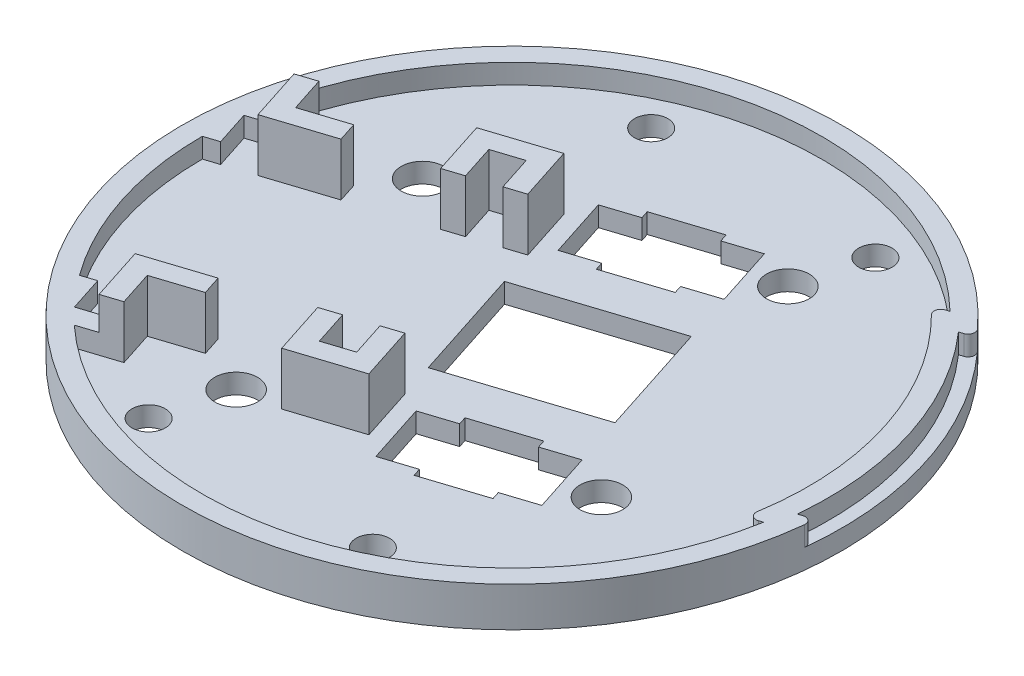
ISO-10303-21;
HEADER;
FILE_DESCRIPTION(('STEP AP214'),'2;1');
FILE_NAME('part.step','',(''),(''),'','','');
FILE_SCHEMA(('AUTOMOTIVE_DESIGN { 1 0 10303 214 1 1 1 1 }'));
ENDSEC;
DATA;
#1=APPLICATION_CONTEXT('core data for automotive mechanical design processes');
#2=APPLICATION_PROTOCOL_DEFINITION('international standard','automotive_design',2000,#1);
#3=PRODUCT_CONTEXT('',#1,'mechanical');
#4=PRODUCT('Part','Part','',(#3));
#5=PRODUCT_RELATED_PRODUCT_CATEGORY('part','',(#4));
#6=PRODUCT_DEFINITION_FORMATION('','',#4);
#7=PRODUCT_DEFINITION_CONTEXT('part definition',#1,'design');
#8=PRODUCT_DEFINITION('design','',#6,#7);
#9=PRODUCT_DEFINITION_SHAPE('','',#8);
#10=(LENGTH_UNIT() NAMED_UNIT(*) SI_UNIT(.MILLI.,.METRE.));
#11=(NAMED_UNIT(*) PLANE_ANGLE_UNIT() SI_UNIT($,.RADIAN.));
#12=(NAMED_UNIT(*) SI_UNIT($,.STERADIAN.) SOLID_ANGLE_UNIT());
#13=UNCERTAINTY_MEASURE_WITH_UNIT(LENGTH_MEASURE(1.E-05),#10,'distance_accuracy_value','');
#14=(GEOMETRIC_REPRESENTATION_CONTEXT(3) GLOBAL_UNCERTAINTY_ASSIGNED_CONTEXT((#13)) GLOBAL_UNIT_ASSIGNED_CONTEXT((#10,
#11,#12)) REPRESENTATION_CONTEXT('',''));
#15=CARTESIAN_POINT('',(0.,0.,0.));
#16=DIRECTION('',(0.,0.,1.));
#17=DIRECTION('',(1.,0.,0.));
#18=AXIS2_PLACEMENT_3D('',#15,#16,#17);
#19=CARTESIAN_POINT('',(0.,4.5,0.));
#20=DIRECTION('',(0.,-1.,0.));
#21=DIRECTION('',(0.,0.,-1.));
#22=AXIS2_PLACEMENT_3D('',#19,#20,#21);
#23=CYLINDRICAL_SURFACE('',#22,47.);
#24=CARTESIAN_POINT('',(0.,4.5,0.));
#25=DIRECTION('',(0.,1.,0.));
#26=DIRECTION('',(0.,0.,1.));
#27=AXIS2_PLACEMENT_3D('',#24,#25,#26);
#28=CIRCLE('',#27,47.);
#29=CARTESIAN_POINT('',(-31.9002259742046,4.5,34.5163089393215));
#30=VERTEX_POINT('',#29);
#31=CARTESIAN_POINT('',(46.2926372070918,4.5,8.12353004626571));
#32=VERTEX_POINT('',#31);
#33=EDGE_CURVE('E1033',#30,#32,#28,.T.);
#34=ORIENTED_EDGE('',*,*,#33,.T.);
#35=DIRECTION('',(0.,-1.,0.));
#36=VECTOR('',#35,1.);
#37=CARTESIAN_POINT('',(46.2926372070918,50.4933208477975,8.12353004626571));
#38=LINE('',#37,#36);
#39=CARTESIAN_POINT('',(46.2926372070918,1.5,8.12353004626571));
#40=VERTEX_POINT('',#39);
#41=EDGE_CURVE('E1225',#32,#40,#38,.T.);
#42=ORIENTED_EDGE('',*,*,#41,.T.);
#43=CARTESIAN_POINT('',(0.,1.5,0.));
#44=DIRECTION('',(0.,1.,0.));
#45=DIRECTION('',(0.,0.,1.));
#46=AXIS2_PLACEMENT_3D('',#43,#44,#45);
#47=CIRCLE('',#46,47.);
#48=CARTESIAN_POINT('',(-31.9002259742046,1.5,34.5163089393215));
#49=VERTEX_POINT('',#48);
#50=EDGE_CURVE('E1041',#40,#49,#47,.F.);
#51=ORIENTED_EDGE('',*,*,#50,.T.);
#52=DIRECTION('',(0.,-1.,0.));
#53=VECTOR('',#52,1.);
#54=CARTESIAN_POINT('',(-31.9002259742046,48.720804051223,34.5163089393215));
#55=LINE('',#54,#53);
#56=EDGE_CURVE('E887',#30,#49,#55,.T.);
#57=ORIENTED_EDGE('',*,*,#56,.F.);
#58=EDGE_LOOP('',(#34,#42,#51,#57));
#59=FACE_BOUND('',#58,.T.);
#60=ADVANCED_FACE('F34',(#59),#23,.F.);
#61=CARTESIAN_POINT('',(0.,1.5,0.));
#62=DIRECTION('',(0.,1.,0.));
#63=DIRECTION('',(0.,0.,1.));
#64=AXIS2_PLACEMENT_3D('',#61,#62,#63);
#65=PLANE('',#64);
#66=DIRECTION('',(0.951288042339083,0.,-0.308303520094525));
#67=VECTOR('',#66,1.);
#68=CARTESIAN_POINT('',(38.1386623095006,1.5,-32.3333022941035));
#69=LINE('',#68,#67);
#70=CARTESIAN_POINT('',(36.0745093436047,1.5,-31.66432970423));
#71=VERTEX_POINT('',#70);
#72=CARTESIAN_POINT('',(36.6957620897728,1.5,-31.8656718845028));
#73=VERTEX_POINT('',#72);
#74=EDGE_CURVE('E1079',#71,#73,#69,.T.);
#75=ORIENTED_EDGE('',*,*,#74,.F.);
#76=CARTESIAN_POINT('',(0.,1.5,0.));
#77=DIRECTION('',(0.,1.,0.));
#78=DIRECTION('',(0.,0.,1.));
#79=AXIS2_PLACEMENT_3D('',#76,#77,#78);
#80=CIRCLE('',#79,48.);
#81=CARTESIAN_POINT('',(47.7900431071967,1.5,4.48461590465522));
#82=VERTEX_POINT('',#81);
#83=EDGE_CURVE('E1317',#82,#71,#80,.T.);
#84=ORIENTED_EDGE('',*,*,#83,.F.);
#85=DIRECTION('',(-0.951288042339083,0.,0.308303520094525));
#86=VECTOR('',#85,1.);
#87=CARTESIAN_POINT('',(49.8541960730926,1.5,3.81564331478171));
#88=LINE('',#87,#86);
#89=CARTESIAN_POINT('',(48.4112958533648,1.5,4.28327372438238));
#90=VERTEX_POINT('',#89);
#91=EDGE_CURVE('E1115',#90,#82,#88,.T.);
#92=ORIENTED_EDGE('',*,*,#91,.F.);
#93=CARTESIAN_POINT('',(48.7195993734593,1.5,5.23456176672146));
#94=DIRECTION('',(0.,1.,0.));
#95=DIRECTION('',(0.,0.,1.));
#96=AXIS2_PLACEMENT_3D('',#93,#94,#95);
#97=CIRCLE('',#96,1.);
#98=CARTESIAN_POINT('',(49.7138769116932,1.5,5.34138955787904));
#99=VERTEX_POINT('',#98);
#100=EDGE_CURVE('E1069',#90,#99,#97,.F.);
#101=ORIENTED_EDGE('',*,*,#100,.T.);
#102=CARTESIAN_POINT('',(0.,1.5,0.));
#103=DIRECTION('',(0.,1.,0.));
#104=DIRECTION('',(0.,0.,1.));
#105=AXIS2_PLACEMENT_3D('',#102,#103,#104);
#106=CIRCLE('',#105,50.);
#107=CARTESIAN_POINT('',(37.1300597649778,1.5,-33.4866938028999));
#108=VERTEX_POINT('',#107);
#109=EDGE_CURVE('E1081',#108,#99,#106,.F.);
#110=ORIENTED_EDGE('',*,*,#109,.F.);
#111=CARTESIAN_POINT('',(36.3874585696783,1.5,-32.8169599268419));
#112=DIRECTION('',(0.,1.,0.));
#113=DIRECTION('',(0.,0.,1.));
#114=AXIS2_PLACEMENT_3D('',#111,#112,#113);
#115=CIRCLE('',#114,1.);
#116=EDGE_CURVE('E1072',#108,#73,#115,.F.);
#117=ORIENTED_EDGE('',*,*,#116,.T.);
#118=EDGE_LOOP('',(#75,#84,#92,#101,#110,#117));
#119=FACE_BOUND('',#118,.T.);
#120=ADVANCED_FACE('F1077',(#119),#65,.T.);
#121=CARTESIAN_POINT('',(27.7110143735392,1.5,14.1456594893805));
#122=DIRECTION('',(0.,1.,0.));
#123=DIRECTION('',(0.,0.,1.));
#124=AXIS2_PLACEMENT_3D('',#121,#122,#123);
#125=CIRCLE('',#124,3.25);
#126=CARTESIAN_POINT('',(27.7110143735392,1.5,17.3956594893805));
#127=VERTEX_POINT('',#126);
#128=EDGE_CURVE('E580',#127,#127,#125,.T.);
#129=ORIENTED_EDGE('',*,*,#128,.F.);
#130=EDGE_LOOP('',(#129));
#131=FACE_BOUND('',#130,.T.);
#132=CARTESIAN_POINT('',(14.1456594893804,1.5,-27.7110143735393));
#133=DIRECTION('',(0.,1.,0.));
#134=DIRECTION('',(0.,0.,1.));
#135=AXIS2_PLACEMENT_3D('',#132,#133,#134);
#136=CIRCLE('',#135,3.25);
#137=CARTESIAN_POINT('',(14.1456594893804,1.5,-24.4610143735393));
#138=VERTEX_POINT('',#137);
#139=EDGE_CURVE('E584',#138,#138,#136,.T.);
#140=ORIENTED_EDGE('',*,*,#139,.F.);
#141=EDGE_LOOP('',(#140));
#142=FACE_BOUND('',#141,.T.);
#143=CARTESIAN_POINT('',(-27.7110143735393,1.5,-14.1456594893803));
#144=DIRECTION('',(0.,1.,0.));
#145=DIRECTION('',(0.,0.,1.));
#146=AXIS2_PLACEMENT_3D('',#143,#144,#145);
#147=CIRCLE('',#146,3.25);
#148=CARTESIAN_POINT('',(-27.7110143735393,1.5,-10.8956594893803));
#149=VERTEX_POINT('',#148);
#150=EDGE_CURVE('E590',#149,#149,#147,.T.);
#151=ORIENTED_EDGE('',*,*,#150,.F.);
#152=EDGE_LOOP('',(#151));
#153=FACE_BOUND('',#152,.T.);
#154=CARTESIAN_POINT('',(-14.1456594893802,1.5,27.7110143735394));
#155=DIRECTION('',(0.,1.,0.));
#156=DIRECTION('',(0.,0.,1.));
#157=AXIS2_PLACEMENT_3D('',#154,#155,#156);
#158=CIRCLE('',#157,3.25);
#159=CARTESIAN_POINT('',(-14.1456594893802,1.5,30.9610143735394));
#160=VERTEX_POINT('',#159);
#161=EDGE_CURVE('E596',#160,#160,#158,.T.);
#162=ORIENTED_EDGE('',*,*,#161,.F.);
#163=EDGE_LOOP('',(#162));
#164=FACE_BOUND('',#163,.T.);
#165=DIRECTION('',(0.951288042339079,0.,-0.308303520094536));
#166=VECTOR('',#165,1.);
#167=CARTESIAN_POINT('',(19.2706018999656,1.5,21.3487447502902));
#168=LINE('',#167,#166);
#169=CARTESIAN_POINT('',(19.2706018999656,1.5,21.3487447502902));
#170=VERTEX_POINT('',#169);
#171=CARTESIAN_POINT('',(24.2648641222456,1.5,19.7301512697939));
#172=VERTEX_POINT('',#171);
#173=EDGE_CURVE('E602',#170,#172,#168,.T.);
#174=ORIENTED_EDGE('',*,*,#173,.F.);
#175=DIRECTION('',(-0.308303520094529,0.,-0.951288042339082));
#176=VECTOR('',#175,1.);
#177=CARTESIAN_POINT('',(19.2706018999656,1.5,21.3487447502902));
#178=LINE('',#177,#176);
#179=CARTESIAN_POINT('',(19.6559813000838,1.5,22.537854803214));
#180=VERTEX_POINT('',#179);
#181=EDGE_CURVE('E609',#180,#170,#178,.T.);
#182=ORIENTED_EDGE('',*,*,#181,.F.);
#183=DIRECTION('',(0.951288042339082,0.,-0.308303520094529));
#184=VECTOR('',#183,1.);
#185=CARTESIAN_POINT('',(10.6187448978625,1.5,25.4667382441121));
#186=LINE('',#185,#184);
#187=CARTESIAN_POINT('',(10.6187448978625,1.5,25.4667382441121));
#188=VERTEX_POINT('',#187);
#189=EDGE_CURVE('E671',#188,#180,#186,.T.);
#190=ORIENTED_EDGE('',*,*,#189,.F.);
#191=DIRECTION('',(0.30830352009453,0.,0.951288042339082));
#192=VECTOR('',#191,1.);
#193=CARTESIAN_POINT('',(10.2333654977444,1.5,24.2776281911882));
#194=LINE('',#193,#192);
#195=CARTESIAN_POINT('',(10.2333654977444,1.5,24.2776281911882));
#196=VERTEX_POINT('',#195);
#197=EDGE_CURVE('E668',#196,#188,#194,.T.);
#198=ORIENTED_EDGE('',*,*,#197,.F.);
#199=DIRECTION('',(0.951288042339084,0.,-0.308303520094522));
#200=VECTOR('',#199,1.);
#201=CARTESIAN_POINT('',(5.23910327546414,1.5,25.8962216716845));
#202=LINE('',#201,#200);
#203=CARTESIAN_POINT('',(5.23910327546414,1.5,25.8962216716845));
#204=VERTEX_POINT('',#203);
#205=EDGE_CURVE('E665',#204,#196,#202,.T.);
#206=ORIENTED_EDGE('',*,*,#205,.F.);
#207=DIRECTION('',(0.308303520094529,0.,0.951288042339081));
#208=VECTOR('',#207,1.);
#209=CARTESIAN_POINT('',(5.23910327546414,1.5,25.8962216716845));
#210=LINE('',#209,#208);
#211=CARTESIAN_POINT('',(2.3102198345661,1.5,16.8589852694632));
#212=VERTEX_POINT('',#211);
#213=EDGE_CURVE('E662',#212,#204,#210,.T.);
#214=ORIENTED_EDGE('',*,*,#213,.F.);
#215=DIRECTION('',(-0.951288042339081,0.,0.30830352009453));
#216=VECTOR('',#215,1.);
#217=CARTESIAN_POINT('',(2.3102198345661,1.5,16.8589852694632));
#218=LINE('',#217,#216);
#219=CARTESIAN_POINT('',(7.3044820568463,1.5,15.2403917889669));
#220=VERTEX_POINT('',#219);
#221=EDGE_CURVE('E659',#220,#212,#218,.T.);
#222=ORIENTED_EDGE('',*,*,#221,.F.);
#223=DIRECTION('',(0.308303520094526,0.,0.951288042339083));
#224=VECTOR('',#223,1.);
#225=CARTESIAN_POINT('',(7.3044820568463,1.5,15.2403917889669));
#226=LINE('',#225,#224);
#227=CARTESIAN_POINT('',(6.91910265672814,1.5,14.051281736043));
#228=VERTEX_POINT('',#227);
#229=EDGE_CURVE('E656',#228,#220,#226,.T.);
#230=ORIENTED_EDGE('',*,*,#229,.F.);
#231=DIRECTION('',(-0.951288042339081,0.,0.30830352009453));
#232=VECTOR('',#231,1.);
#233=CARTESIAN_POINT('',(6.91910265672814,1.5,14.051281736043));
#234=LINE('',#233,#232);
#235=CARTESIAN_POINT('',(15.9563390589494,1.5,11.122398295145));
#236=VERTEX_POINT('',#235);
#237=EDGE_CURVE('E653',#236,#228,#234,.T.);
#238=ORIENTED_EDGE('',*,*,#237,.F.);
#239=DIRECTION('',(-0.308303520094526,0.,-0.951288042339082));
#240=VECTOR('',#239,1.);
#241=CARTESIAN_POINT('',(15.9563390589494,1.5,11.122398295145));
#242=LINE('',#241,#240);
#243=CARTESIAN_POINT('',(16.3417184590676,1.5,12.3115083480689));
#244=VERTEX_POINT('',#243);
#245=EDGE_CURVE('E650',#244,#236,#242,.T.);
#246=ORIENTED_EDGE('',*,*,#245,.F.);
#247=DIRECTION('',(-0.951288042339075,0.,0.30830352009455));
#248=VECTOR('',#247,1.);
#249=CARTESIAN_POINT('',(16.3417184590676,1.5,12.3115083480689));
#250=LINE('',#249,#248);
#251=CARTESIAN_POINT('',(21.3359806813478,1.5,10.6929148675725));
#252=VERTEX_POINT('',#251);
#253=EDGE_CURVE('E647',#252,#244,#250,.T.);
#254=ORIENTED_EDGE('',*,*,#253,.F.);
#255=DIRECTION('',(-0.3083035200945,0.,-0.951288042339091));
#256=VECTOR('',#255,1.);
#257=CARTESIAN_POINT('',(21.3359806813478,1.5,10.6929148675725));
#258=LINE('',#257,#256);
#259=EDGE_CURVE('E644',#172,#252,#258,.T.);
#260=ORIENTED_EDGE('',*,*,#259,.F.);
#261=EDGE_LOOP('',(#174,#182,#190,#198,#206,#214,#222,#230,#238,#246,#254,#260));
#262=FACE_BOUND('',#261,.T.);
#263=DIRECTION('',(0.951288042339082,0.,-0.308303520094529));
#264=VECTOR('',#263,1.);
#265=CARTESIAN_POINT('',(18.9466284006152,1.5,3.32043253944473));
#266=LINE('',#265,#264);
#267=CARTESIAN_POINT('',(-2.45735255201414,1.5,10.2572617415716));
#268=VERTEX_POINT('',#267);
#269=CARTESIAN_POINT('',(18.9466284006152,1.5,3.32043253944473));
#270=VERTEX_POINT('',#269);
#271=EDGE_CURVE('E678',#268,#270,#266,.T.);
#272=ORIENTED_EDGE('',*,*,#271,.F.);
#273=DIRECTION('',(0.30830352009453,0.,0.951288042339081));
#274=VECTOR('',#273,1.);
#275=CARTESIAN_POINT('',(-2.45735255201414,1.5,10.2572617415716));
#276=LINE('',#275,#274);
#277=CARTESIAN_POINT('',(-8.00681591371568,1.5,-6.86592302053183));
#278=VERTEX_POINT('',#277);
#279=EDGE_CURVE('E705',#278,#268,#276,.T.);
#280=ORIENTED_EDGE('',*,*,#279,.F.);
#281=DIRECTION('',(-0.951288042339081,0.,0.30830352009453));
#282=VECTOR('',#281,1.);
#283=CARTESIAN_POINT('',(-8.00681591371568,1.5,-6.86592302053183));
#284=LINE('',#283,#282);
#285=CARTESIAN_POINT('',(13.3971650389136,1.5,-13.8027522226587));
#286=VERTEX_POINT('',#285);
#287=EDGE_CURVE('E719',#286,#278,#284,.T.);
#288=ORIENTED_EDGE('',*,*,#287,.F.);
#289=DIRECTION('',(-0.30830352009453,0.,-0.951288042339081));
#290=VECTOR('',#289,1.);
#291=CARTESIAN_POINT('',(13.3971650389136,1.5,-13.8027522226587));
#292=LINE('',#291,#290);
#293=EDGE_CURVE('E716',#270,#286,#292,.T.);
#294=ORIENTED_EDGE('',*,*,#293,.F.);
#295=EDGE_LOOP('',(#272,#280,#288,#294));
#296=FACE_BOUND('',#295,.T.);
#297=DIRECTION('',(0.30830352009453,0.,0.951288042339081));
#298=VECTOR('',#297,1.);
#299=CARTESIAN_POINT('',(-10.9468315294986,1.5,-24.0464005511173));
#300=LINE('',#299,#298);
#301=CARTESIAN_POINT('',(-10.9468315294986,1.5,-24.0464005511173));
#302=VERTEX_POINT('',#301);
#303=CARTESIAN_POINT('',(-8.01794808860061,1.5,-15.009164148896));
#304=VERTEX_POINT('',#303);
#305=EDGE_CURVE('E726',#302,#304,#300,.T.);
#306=ORIENTED_EDGE('',*,*,#305,.F.);
#307=DIRECTION('',(-0.951288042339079,0.,0.308303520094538));
#308=VECTOR('',#307,1.);
#309=CARTESIAN_POINT('',(-10.9468315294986,1.5,-24.0464005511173));
#310=LINE('',#309,#308);
#311=CARTESIAN_POINT('',(-5.95256930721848,1.5,-25.6649940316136));
#312=VERTEX_POINT('',#311);
#313=EDGE_CURVE('E737',#312,#302,#310,.T.);
#314=ORIENTED_EDGE('',*,*,#313,.F.);
#315=DIRECTION('',(0.308303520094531,0.,0.951288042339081));
#316=VECTOR('',#315,1.);
#317=CARTESIAN_POINT('',(-5.95256930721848,1.5,-25.6649940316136));
#318=LINE('',#317,#316);
#319=CARTESIAN_POINT('',(-6.33794870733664,1.5,-26.8541040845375));
#320=VERTEX_POINT('',#319);
#321=EDGE_CURVE('E799',#320,#312,#318,.T.);
#322=ORIENTED_EDGE('',*,*,#321,.F.);
#323=DIRECTION('',(-0.951288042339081,0.,0.30830352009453));
#324=VECTOR('',#323,1.);
#325=CARTESIAN_POINT('',(-6.33794870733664,1.5,-26.8541040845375));
#326=LINE('',#325,#324);
#327=CARTESIAN_POINT('',(2.69928769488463,1.5,-29.7829875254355));
#328=VERTEX_POINT('',#327);
#329=EDGE_CURVE('E796',#328,#320,#326,.T.);
#330=ORIENTED_EDGE('',*,*,#329,.F.);
#331=DIRECTION('',(-0.308303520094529,0.,-0.951288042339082));
#332=VECTOR('',#331,1.);
#333=CARTESIAN_POINT('',(3.0846670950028,1.5,-28.5938774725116));
#334=LINE('',#333,#332);
#335=CARTESIAN_POINT('',(3.0846670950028,1.5,-28.5938774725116));
#336=VERTEX_POINT('',#335);
#337=EDGE_CURVE('E793',#336,#328,#334,.T.);
#338=ORIENTED_EDGE('',*,*,#337,.F.);
#339=DIRECTION('',(-0.951288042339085,0.,0.30830352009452));
#340=VECTOR('',#339,1.);
#341=CARTESIAN_POINT('',(3.0846670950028,1.5,-28.5938774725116));
#342=LINE('',#341,#340);
#343=CARTESIAN_POINT('',(8.07892931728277,1.5,-30.2124709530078));
#344=VERTEX_POINT('',#343);
#345=EDGE_CURVE('E790',#344,#336,#342,.T.);
#346=ORIENTED_EDGE('',*,*,#345,.F.);
#347=DIRECTION('',(-0.308303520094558,0.,-0.951288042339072));
#348=VECTOR('',#347,1.);
#349=CARTESIAN_POINT('',(11.0078127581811,1.5,-21.1752345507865));
#350=LINE('',#349,#348);
#351=CARTESIAN_POINT('',(11.0078127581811,1.5,-21.1752345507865));
#352=VERTEX_POINT('',#351);
#353=EDGE_CURVE('E787',#352,#344,#350,.T.);
#354=ORIENTED_EDGE('',*,*,#353,.F.);
#355=DIRECTION('',(0.951288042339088,0.,-0.308303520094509));
#356=VECTOR('',#355,1.);
#357=CARTESIAN_POINT('',(6.01355053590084,1.5,-19.5566410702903));
#358=LINE('',#357,#356);
#359=CARTESIAN_POINT('',(6.01355053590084,1.5,-19.5566410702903));
#360=VERTEX_POINT('',#359);
#361=EDGE_CURVE('E784',#360,#352,#358,.T.);
#362=ORIENTED_EDGE('',*,*,#361,.F.);
#363=DIRECTION('',(-0.308303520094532,0.,-0.95128804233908));
#364=VECTOR('',#363,1.);
#365=CARTESIAN_POINT('',(6.39892993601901,1.5,-18.3675310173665));
#366=LINE('',#365,#364);
#367=CARTESIAN_POINT('',(6.39892993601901,1.5,-18.3675310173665));
#368=VERTEX_POINT('',#367);
#369=EDGE_CURVE('E781',#368,#360,#366,.T.);
#370=ORIENTED_EDGE('',*,*,#369,.F.);
#371=DIRECTION('',(0.951288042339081,0.,-0.30830352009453));
#372=VECTOR('',#371,1.);
#373=CARTESIAN_POINT('',(-2.63830646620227,1.5,-15.4386475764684));
#374=LINE('',#373,#372);
#375=CARTESIAN_POINT('',(-2.63830646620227,1.5,-15.4386475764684));
#376=VERTEX_POINT('',#375);
#377=EDGE_CURVE('E778',#376,#368,#374,.T.);
#378=ORIENTED_EDGE('',*,*,#377,.F.);
#379=DIRECTION('',(0.308303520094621,0.,0.951288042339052));
#380=VECTOR('',#379,1.);
#381=CARTESIAN_POINT('',(-3.02368586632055,1.5,-16.6277576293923));
#382=LINE('',#381,#380);
#383=CARTESIAN_POINT('',(-3.02368586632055,1.5,-16.6277576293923));
#384=VERTEX_POINT('',#383);
#385=EDGE_CURVE('E775',#384,#376,#382,.T.);
#386=ORIENTED_EDGE('',*,*,#385,.F.);
#387=DIRECTION('',(0.951288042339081,0.,-0.308303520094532));
#388=VECTOR('',#387,1.);
#389=CARTESIAN_POINT('',(-8.01794808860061,1.5,-15.009164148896));
#390=LINE('',#389,#388);
#391=EDGE_CURVE('E772',#304,#384,#390,.T.);
#392=ORIENTED_EDGE('',*,*,#391,.F.);
#393=EDGE_LOOP('',(#306,#314,#322,#330,#338,#346,#354,#362,#370,#378,#386,#392));
#394=FACE_BOUND('',#393,.T.);
#395=DIRECTION('',(0.951288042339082,0.,-0.308303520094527));
#396=VECTOR('',#395,1.);
#397=CARTESIAN_POINT('',(-40.6193466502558,1.5,-2.07814285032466));
#398=LINE('',#397,#396);
#399=CARTESIAN_POINT('',(-19.6910097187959,1.5,-8.86082029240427));
#400=VERTEX_POINT('',#399);
#401=CARTESIAN_POINT('',(-16.8371455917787,1.5,-9.78573085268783));
#402=VERTEX_POINT('',#401);
#403=EDGE_CURVE('E931',#400,#402,#398,.T.);
#404=ORIENTED_EDGE('',*,*,#403,.F.);
#405=DIRECTION('',(0.308303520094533,0.,0.95128804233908));
#406=VECTOR('',#405,1.);
#407=CARTESIAN_POINT('',(-22.3115896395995,1.5,-16.9467686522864));
#408=LINE('',#407,#406);
#409=CARTESIAN_POINT('',(-22.3115896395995,1.5,-16.9467686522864));
#410=VERTEX_POINT('',#409);
#411=EDGE_CURVE('E960',#410,#400,#408,.T.);
#412=ORIENTED_EDGE('',*,*,#411,.F.);
#413=DIRECTION('',(-0.951288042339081,0.,0.308303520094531));
#414=VECTOR('',#413,1.);
#415=CARTESIAN_POINT('',(-12.3230651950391,1.5,-20.183955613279));
#416=LINE('',#415,#414);
#417=CARTESIAN_POINT('',(-12.3230651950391,1.5,-20.183955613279));
#418=VERTEX_POINT('',#417);
#419=EDGE_CURVE('E963',#418,#410,#416,.T.);
#420=ORIENTED_EDGE('',*,*,#419,.F.);
#421=DIRECTION('',(-0.30830352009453,0.,-0.951288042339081));
#422=VECTOR('',#421,1.);
#423=CARTESIAN_POINT('',(-9.70248527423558,1.5,-12.0980072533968));
#424=LINE('',#423,#422);
#425=CARTESIAN_POINT('',(-9.70248527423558,1.5,-12.0980072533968));
#426=VERTEX_POINT('',#425);
#427=EDGE_CURVE('E967',#426,#418,#424,.T.);
#428=ORIENTED_EDGE('',*,*,#427,.F.);
#429=DIRECTION('',(0.951288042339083,0.,-0.308303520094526));
#430=VECTOR('',#429,1.);
#431=CARTESIAN_POINT('',(-12.5563494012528,1.5,-11.1730966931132));
#432=LINE('',#431,#430);
#433=CARTESIAN_POINT('',(-12.5563494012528,1.5,-11.1730966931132));
#434=VERTEX_POINT('',#433);
#435=EDGE_CURVE('E971',#434,#426,#432,.T.);
#436=ORIENTED_EDGE('',*,*,#435,.F.);
#437=DIRECTION('',(0.308303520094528,0.,0.951288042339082));
#438=VECTOR('',#437,1.);
#439=CARTESIAN_POINT('',(-14.2520187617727,1.5,-16.4051809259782));
#440=LINE('',#439,#438);
#441=CARTESIAN_POINT('',(-14.2520187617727,1.5,-16.4051809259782));
#442=VERTEX_POINT('',#441);
#443=EDGE_CURVE('E975',#442,#434,#440,.T.);
#444=ORIENTED_EDGE('',*,*,#443,.F.);
#445=DIRECTION('',(0.951288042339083,0.,-0.308303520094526));
#446=VECTOR('',#445,1.);
#447=CARTESIAN_POINT('',(-18.5328149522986,1.5,-15.0178150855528));
#448=LINE('',#447,#446);
#449=CARTESIAN_POINT('',(-18.5328149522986,1.5,-15.0178150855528));
#450=VERTEX_POINT('',#449);
#451=EDGE_CURVE('E979',#450,#442,#448,.T.);
#452=ORIENTED_EDGE('',*,*,#451,.F.);
#453=DIRECTION('',(-0.308303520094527,0.,-0.951288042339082));
#454=VECTOR('',#453,1.);
#455=CARTESIAN_POINT('',(-16.8371455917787,1.5,-9.78573085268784));
#456=LINE('',#455,#454);
#457=EDGE_CURVE('E983',#402,#450,#456,.T.);
#458=ORIENTED_EDGE('',*,*,#457,.F.);
#459=EDGE_LOOP('',(#404,#412,#420,#428,#436,#444,#452,#458));
#460=FACE_BOUND('',#459,.T.);
#461=DIRECTION('',(0.308303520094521,0.,0.951288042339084));
#462=VECTOR('',#461,1.);
#463=CARTESIAN_POINT('',(-8.1296277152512,1.5,26.8124812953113));
#464=LINE('',#463,#462);
#465=CARTESIAN_POINT('',(-10.7502076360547,1.5,18.7265329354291));
#466=VERTEX_POINT('',#465);
#467=CARTESIAN_POINT('',(-8.1296277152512,1.5,26.8124812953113));
#468=VERTEX_POINT('',#467);
#469=EDGE_CURVE('E875',#466,#468,#464,.T.);
#470=ORIENTED_EDGE('',*,*,#469,.F.);
#471=DIRECTION('',(-0.951288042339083,0.,0.308303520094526));
#472=VECTOR('',#471,1.);
#473=CARTESIAN_POINT('',(-31.6785445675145,1.5,25.5092103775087));
#474=LINE('',#473,#472);
#475=CARTESIAN_POINT('',(-7.89634350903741,1.5,17.8016223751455));
#476=VERTEX_POINT('',#475);
#477=EDGE_CURVE('E846',#476,#466,#474,.T.);
#478=ORIENTED_EDGE('',*,*,#477,.F.);
#479=DIRECTION('',(-0.308303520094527,0.,-0.951288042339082));
#480=VECTOR('',#479,1.);
#481=CARTESIAN_POINT('',(-7.8963435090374,1.5,17.8016223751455));
#482=LINE('',#481,#480);
#483=CARTESIAN_POINT('',(-6.2006741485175,1.5,23.0337066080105));
#484=VERTEX_POINT('',#483);
#485=EDGE_CURVE('E850',#484,#476,#482,.T.);
#486=ORIENTED_EDGE('',*,*,#485,.F.);
#487=DIRECTION('',(-0.951288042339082,0.,0.308303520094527));
#488=VECTOR('',#487,1.);
#489=CARTESIAN_POINT('',(-6.2006741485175,1.5,23.0337066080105));
#490=LINE('',#489,#488);
#491=CARTESIAN_POINT('',(-1.91987795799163,1.5,21.6463407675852));
#492=VERTEX_POINT('',#491);
#493=EDGE_CURVE('E855',#492,#484,#490,.T.);
#494=ORIENTED_EDGE('',*,*,#493,.F.);
#495=DIRECTION('',(0.308303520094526,0.,0.951288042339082));
#496=VECTOR('',#495,1.);
#497=CARTESIAN_POINT('',(-1.91987795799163,1.5,21.6463407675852));
#498=LINE('',#497,#496);
#499=CARTESIAN_POINT('',(-3.61554731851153,1.5,16.4142565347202));
#500=VERTEX_POINT('',#499);
#501=EDGE_CURVE('E859',#500,#492,#498,.T.);
#502=ORIENTED_EDGE('',*,*,#501,.F.);
#503=DIRECTION('',(-0.951288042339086,0.,0.308303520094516));
#504=VECTOR('',#503,1.);
#505=CARTESIAN_POINT('',(-3.61554731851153,1.5,16.4142565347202));
#506=LINE('',#505,#504);
#507=CARTESIAN_POINT('',(-0.761683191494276,1.5,15.4893459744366));
#508=VERTEX_POINT('',#507);
#509=EDGE_CURVE('E863',#508,#500,#506,.T.);
#510=ORIENTED_EDGE('',*,*,#509,.F.);
#511=DIRECTION('',(-0.308303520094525,0.,-0.951288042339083));
#512=VECTOR('',#511,1.);
#513=CARTESIAN_POINT('',(-0.761683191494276,1.5,15.4893459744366));
#514=LINE('',#513,#512);
#515=CARTESIAN_POINT('',(1.85889672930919,1.5,23.5752943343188));
#516=VERTEX_POINT('',#515);
#517=EDGE_CURVE('E867',#516,#508,#514,.T.);
#518=ORIENTED_EDGE('',*,*,#517,.F.);
#519=DIRECTION('',(0.951288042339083,0.,-0.308303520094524));
#520=VECTOR('',#519,1.);
#521=CARTESIAN_POINT('',(1.85889672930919,1.5,23.5752943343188));
#522=LINE('',#521,#520);
#523=EDGE_CURVE('E871',#468,#516,#522,.T.);
#524=ORIENTED_EDGE('',*,*,#523,.F.);
#525=EDGE_LOOP('',(#470,#478,#486,#494,#502,#510,#518,#524));
#526=FACE_BOUND('',#525,.T.);
#527=CARTESIAN_POINT('',(-17.0092592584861,1.5,38.1280421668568));
#528=DIRECTION('',(0.,1.,0.));
#529=DIRECTION('',(0.,0.,1.));
#530=AXIS2_PLACEMENT_3D('',#527,#528,#529);
#531=CIRCLE('',#530,2.52729999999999);
#532=CARTESIAN_POINT('',(-17.0092592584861,1.5,40.6553421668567));
#533=VERTEX_POINT('',#532);
#534=EDGE_CURVE('E1139',#533,#533,#531,.T.);
#535=ORIENTED_EDGE('',*,*,#534,.F.);
#536=EDGE_LOOP('',(#535));
#537=FACE_BOUND('',#536,.T.);
#538=CARTESIAN_POINT('',(-17.009259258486,1.5,-38.1280421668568));
#539=DIRECTION('',(0.,1.,0.));
#540=DIRECTION('',(0.,0.,1.));
#541=AXIS2_PLACEMENT_3D('',#538,#539,#540);
#542=CIRCLE('',#541,2.52729999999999);
#543=CARTESIAN_POINT('',(-17.009259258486,1.5,-35.6007421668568));
#544=VERTEX_POINT('',#543);
#545=EDGE_CURVE('E1133',#544,#544,#542,.T.);
#546=ORIENTED_EDGE('',*,*,#545,.F.);
#547=EDGE_LOOP('',(#546));
#548=FACE_BOUND('',#547,.T.);
#549=CARTESIAN_POINT('',(17.009259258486,1.5,-38.1280421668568));
#550=DIRECTION('',(0.,1.,0.));
#551=DIRECTION('',(0.,0.,1.));
#552=AXIS2_PLACEMENT_3D('',#549,#550,#551);
#553=CIRCLE('',#552,2.52729999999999);
#554=CARTESIAN_POINT('',(17.009259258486,1.5,-35.6007421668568));
#555=VERTEX_POINT('',#554);
#556=EDGE_CURVE('E1127',#555,#555,#553,.T.);
#557=ORIENTED_EDGE('',*,*,#556,.F.);
#558=EDGE_LOOP('',(#557));
#559=FACE_BOUND('',#558,.T.);
#560=CARTESIAN_POINT('',(17.0092592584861,1.5,38.1280421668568));
#561=DIRECTION('',(0.,1.,0.));
#562=DIRECTION('',(0.,0.,1.));
#563=AXIS2_PLACEMENT_3D('',#560,#561,#562);
#564=CIRCLE('',#563,2.52729999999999);
#565=CARTESIAN_POINT('',(17.0092592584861,1.5,40.6553421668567));
#566=VERTEX_POINT('',#565);
#567=EDGE_CURVE('E1090',#566,#566,#564,.T.);
#568=ORIENTED_EDGE('',*,*,#567,.F.);
#569=EDGE_LOOP('',(#568));
#570=FACE_BOUND('',#569,.T.);
#571=CARTESIAN_POINT('',(0.,1.5,0.));
#572=DIRECTION('',(0.,-1.,0.));
#573=DIRECTION('',(0.,0.,1.));
#574=AXIS2_PLACEMENT_3D('',#571,#572,#573);
#575=CIRCLE('',#574,45.);
#576=CARTESIAN_POINT('',(31.7531417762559,1.5,-31.8863291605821));
#577=VERTEX_POINT('',#576);
#578=CARTESIAN_POINT('',(44.4203951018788,1.5,7.19920127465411));
#579=VERTEX_POINT('',#578);
#580=EDGE_CURVE('E1326',#577,#579,#575,.T.);
#581=ORIENTED_EDGE('',*,*,#580,.F.);
#582=CARTESIAN_POINT('',(32.4587671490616,1.5,-32.5949142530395));
#583=DIRECTION('',(0.,1.,0.));
#584=DIRECTION('',(0.,0.,1.));
#585=AXIS2_PLACEMENT_3D('',#582,#583,#584);
#586=CIRCLE('',#585,1.);
#587=CARTESIAN_POINT('',(32.1504636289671,1.5,-33.5462022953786));
#588=VERTEX_POINT('',#587);
#589=EDGE_CURVE('E42',#577,#588,#586,.F.);
#590=ORIENTED_EDGE('',*,*,#589,.T.);
#591=DIRECTION('',(-0.951288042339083,0.,0.308303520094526));
#592=VECTOR('',#591,1.);
#593=CARTESIAN_POINT('',(32.7272823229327,1.5,-33.7331438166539));
#594=LINE('',#593,#592);
#595=CARTESIAN_POINT('',(32.7272823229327,1.5,-33.7331438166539));
#596=VERTEX_POINT('',#595);
#597=EDGE_CURVE('E1320',#596,#588,#594,.T.);
#598=ORIENTED_EDGE('',*,*,#597,.F.);
#599=CARTESIAN_POINT('',(-46.0821878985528,1.5,-9.24294100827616));
#600=VERTEX_POINT('',#599);
#601=EDGE_CURVE('E1037',#600,#596,#47,.F.);
#602=ORIENTED_EDGE('',*,*,#601,.F.);
#603=DIRECTION('',(-0.951288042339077,0.,0.308303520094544));
#604=VECTOR('',#603,1.);
#605=CARTESIAN_POINT('',(-40.3860624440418,1.5,-11.0890017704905));
#606=LINE('',#605,#604);
#607=CARTESIAN_POINT('',(-40.3860624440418,1.5,-11.0890017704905));
#608=VERTEX_POINT('',#607);
#609=EDGE_CURVE('E949',#608,#600,#606,.T.);
#610=ORIENTED_EDGE('',*,*,#609,.F.);
#611=DIRECTION('',(-0.308303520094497,0.,-0.951288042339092));
#612=VECTOR('',#611,1.);
#613=CARTESIAN_POINT('',(-38.6903930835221,1.5,-5.85691753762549));
#614=LINE('',#613,#612);
#615=CARTESIAN_POINT('',(-38.6903930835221,1.5,-5.85691753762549));
#616=VERTEX_POINT('',#615);
#617=EDGE_CURVE('E954',#616,#608,#614,.T.);
#618=ORIENTED_EDGE('',*,*,#617,.F.);
#619=DIRECTION('',(-0.951288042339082,0.,0.308303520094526));
#620=VECTOR('',#619,1.);
#621=CARTESIAN_POINT('',(-20.6159202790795,1.5,-11.7146844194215));
#622=LINE('',#621,#620);
#623=CARTESIAN_POINT('',(-32.0313767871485,1.5,-8.01504217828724));
#624=VERTEX_POINT('',#623);
#625=EDGE_CURVE('E958',#624,#616,#622,.T.);
#626=ORIENTED_EDGE('',*,*,#625,.F.);
#627=DIRECTION('',(0.308303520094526,0.,0.951288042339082));
#628=VECTOR('',#627,1.);
#629=CARTESIAN_POINT('',(-32.0313767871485,1.5,-8.01504217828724));
#630=LINE('',#629,#628);
#631=CARTESIAN_POINT('',(-31.1064662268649,1.5,-5.16117805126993));
#632=VERTEX_POINT('',#631);
#633=EDGE_CURVE('E535',#624,#632,#630,.T.);
#634=ORIENTED_EDGE('',*,*,#633,.T.);
#635=CARTESIAN_POINT('',(-40.6193466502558,1.5,-2.07814285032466));
#636=VERTEX_POINT('',#635);
#637=EDGE_CURVE('E927',#636,#632,#398,.T.);
#638=ORIENTED_EDGE('',*,*,#637,.F.);
#639=DIRECTION('',(0.308303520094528,0.,0.951288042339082));
#640=VECTOR('',#639,1.);
#641=CARTESIAN_POINT('',(-42.3150160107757,1.5,-7.31022708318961));
#642=LINE('',#641,#640);
#643=CARTESIAN_POINT('',(-42.3150160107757,1.5,-7.31022708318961));
#644=VERTEX_POINT('',#643);
#645=EDGE_CURVE('E932',#644,#636,#642,.T.);
#646=ORIENTED_EDGE('',*,*,#645,.F.);
#647=DIRECTION('',(0.951288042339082,0.,-0.308303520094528));
#648=VECTOR('',#647,1.);
#649=CARTESIAN_POINT('',(-46.5958122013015,1.5,-5.92286124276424));
#650=LINE('',#649,#648);
#651=CARTESIAN_POINT('',(-46.5958122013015,1.5,-5.92286124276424));
#652=VERTEX_POINT('',#651);
#653=EDGE_CURVE('E937',#652,#644,#650,.T.);
#654=ORIENTED_EDGE('',*,*,#653,.F.);
#655=DIRECTION('',(-0.308303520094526,0.,-0.951288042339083));
#656=VECTOR('',#655,1.);
#657=CARTESIAN_POINT('',(-44.9001428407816,1.5,-0.690777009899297));
#658=LINE('',#657,#656);
#659=CARTESIAN_POINT('',(-44.9001428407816,1.5,-0.690777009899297));
#660=VERTEX_POINT('',#659);
#661=EDGE_CURVE('E941',#660,#652,#658,.T.);
#662=ORIENTED_EDGE('',*,*,#661,.F.);
#663=DIRECTION('',(0.951288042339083,0.,-0.308303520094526));
#664=VECTOR('',#663,1.);
#665=CARTESIAN_POINT('',(-46.9999988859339,1.5,-0.0102333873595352));
#666=LINE('',#665,#664);
#667=CARTESIAN_POINT('',(-46.9999988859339,1.5,-0.0102333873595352));
#668=VERTEX_POINT('',#667);
#669=EDGE_CURVE('E945',#668,#660,#666,.T.);
#670=ORIENTED_EDGE('',*,*,#669,.F.);
#671=CARTESIAN_POINT('',(-38.0591968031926,1.5,27.5771198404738));
#672=VERTEX_POINT('',#671);
#673=EDGE_CURVE('E1036',#672,#668,#47,.F.);
#674=ORIENTED_EDGE('',*,*,#673,.F.);
#675=DIRECTION('',(-0.951288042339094,0.,0.30830352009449));
#676=VECTOR('',#675,1.);
#677=CARTESIAN_POINT('',(-38.0591968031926,1.5,27.5771198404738));
#678=LINE('',#677,#676);
#679=CARTESIAN_POINT('',(-35.9593407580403,1.5,26.8965762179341));
#680=VERTEX_POINT('',#679);
#681=EDGE_CURVE('E829',#680,#672,#678,.T.);
#682=ORIENTED_EDGE('',*,*,#681,.F.);
#683=DIRECTION('',(-0.308303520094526,0.,-0.951288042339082));
#684=VECTOR('',#683,1.);
#685=CARTESIAN_POINT('',(-35.9593407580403,1.5,26.8965762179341));
#686=LINE('',#685,#684);
#687=CARTESIAN_POINT('',(-34.2636713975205,1.5,32.128660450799));
#688=VERTEX_POINT('',#687);
#689=EDGE_CURVE('E834',#688,#680,#686,.T.);
#690=ORIENTED_EDGE('',*,*,#689,.F.);
#691=DIRECTION('',(-0.951288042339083,0.,0.308303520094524));
#692=VECTOR('',#691,1.);
#693=CARTESIAN_POINT('',(-34.2636713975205,1.5,32.128660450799));
#694=LINE('',#693,#692);
#695=CARTESIAN_POINT('',(-29.9828752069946,1.5,30.7412946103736));
#696=VERTEX_POINT('',#695);
#697=EDGE_CURVE('E838',#696,#688,#694,.T.);
#698=ORIENTED_EDGE('',*,*,#697,.F.);
#699=DIRECTION('',(0.308303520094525,0.,0.951288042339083));
#700=VECTOR('',#699,1.);
#701=CARTESIAN_POINT('',(-29.9828752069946,1.5,30.7412946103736));
#702=LINE('',#701,#700);
#703=CARTESIAN_POINT('',(-31.6785445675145,1.5,25.5092103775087));
#704=VERTEX_POINT('',#703);
#705=EDGE_CURVE('E842',#704,#696,#702,.T.);
#706=ORIENTED_EDGE('',*,*,#705,.F.);
#707=CARTESIAN_POINT('',(-22.1656641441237,1.5,22.4261751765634));
#708=VERTEX_POINT('',#707);
#709=EDGE_CURVE('E849',#708,#704,#474,.T.);
#710=ORIENTED_EDGE('',*,*,#709,.F.);
#711=CARTESIAN_POINT('',(-21.2407535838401,1.5,25.2800393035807));
#712=VERTEX_POINT('',#711);
#713=EDGE_CURVE('E1147',#708,#712,#630,.T.);
#714=ORIENTED_EDGE('',*,*,#713,.T.);
#715=DIRECTION('',(0.951288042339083,0.,-0.308303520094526));
#716=VECTOR('',#715,1.);
#717=CARTESIAN_POINT('',(-9.82529707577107,1.5,21.5803970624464));
#718=LINE('',#717,#716);
#719=CARTESIAN_POINT('',(-27.8997698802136,1.5,27.4381639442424));
#720=VERTEX_POINT('',#719);
#721=EDGE_CURVE('E534',#720,#712,#718,.T.);
#722=ORIENTED_EDGE('',*,*,#721,.F.);
#723=DIRECTION('',(-0.308303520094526,0.,-0.951288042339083));
#724=VECTOR('',#723,1.);
#725=CARTESIAN_POINT('',(-27.8997698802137,1.5,27.4381639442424));
#726=LINE('',#725,#724);
#727=CARTESIAN_POINT('',(-26.2041005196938,1.5,32.6702481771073));
#728=VERTEX_POINT('',#727);
#729=EDGE_CURVE('E880',#728,#720,#726,.T.);
#730=ORIENTED_EDGE('',*,*,#729,.F.);
#731=DIRECTION('',(0.951288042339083,0.,-0.308303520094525));
#732=VECTOR('',#731,1.);
#733=CARTESIAN_POINT('',(-26.2041005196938,1.5,32.6702481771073));
#734=LINE('',#733,#732);
#735=EDGE_CURVE('E884',#49,#728,#734,.T.);
#736=ORIENTED_EDGE('',*,*,#735,.F.);
#737=ORIENTED_EDGE('',*,*,#50,.F.);
#738=DIRECTION('',(0.951288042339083,0.,-0.308303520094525));
#739=VECTOR('',#738,1.);
#740=CARTESIAN_POINT('',(46.2926372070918,1.5,8.1235300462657));
#741=LINE('',#740,#739);
#742=CARTESIAN_POINT('',(45.7158185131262,1.5,8.31047156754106));
#743=VERTEX_POINT('',#742);
#744=EDGE_CURVE('E1322',#743,#40,#741,.T.);
#745=ORIENTED_EDGE('',*,*,#744,.F.);
#746=CARTESIAN_POINT('',(45.4075149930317,1.5,7.35918352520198));
#747=DIRECTION('',(0.,1.,0.));
#748=DIRECTION('',(0.,0.,1.));
#749=AXIS2_PLACEMENT_3D('',#746,#747,#748);
#750=CIRCLE('',#749,1.);
#751=EDGE_CURVE('E11',#743,#579,#750,.F.);
#752=ORIENTED_EDGE('',*,*,#751,.T.);
#753=EDGE_LOOP('',(#581,#590,#598,#602,#610,#618,#626,#634,#638,#646,#654,#662,#670,#674,#682,
#690,#698,#706,#710,#714,#722,#730,#736,#737,#745,#752));
#754=FACE_BOUND('',#753,.T.);
#755=ADVANCED_FACE('F1205',(#131,#142,#153,#164,#262,#296,#394,#460,#526,#537,#548,#559,#570,
#754),#65,.T.);
#756=ORIENTED_EDGE('',*,*,#601,.T.);
#757=DIRECTION('',(0.,-1.,0.));
#758=VECTOR('',#757,1.);
#759=CARTESIAN_POINT('',(32.7272823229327,50.4933208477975,-33.7331438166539));
#760=LINE('',#759,#758);
#761=CARTESIAN_POINT('',(32.7272823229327,4.5,-33.7331438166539));
#762=VERTEX_POINT('',#761);
#763=EDGE_CURVE('E1316',#762,#596,#760,.T.);
#764=ORIENTED_EDGE('',*,*,#763,.F.);
#765=CARTESIAN_POINT('',(-46.0821878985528,4.5,-9.24294100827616));
#766=VERTEX_POINT('',#765);
#767=EDGE_CURVE('E1029',#762,#766,#28,.T.);
#768=ORIENTED_EDGE('',*,*,#767,.T.);
#769=DIRECTION('',(0.,-1.,0.));
#770=VECTOR('',#769,1.);
#771=CARTESIAN_POINT('',(-46.0821878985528,48.720804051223,-9.24294100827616));
#772=LINE('',#771,#770);
#773=EDGE_CURVE('E952',#766,#600,#772,.T.);
#774=ORIENTED_EDGE('',*,*,#773,.T.);
#775=EDGE_LOOP('',(#756,#764,#768,#774));
#776=FACE_BOUND('',#775,.T.);
#777=ADVANCED_FACE('F1257',(#776),#23,.F.);
#778=CARTESIAN_POINT('',(49.8541960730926,-38.869266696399,3.81564331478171));
#779=DIRECTION('',(0.308303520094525,0.,0.951288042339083));
#780=DIRECTION('',(0.951288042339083,0.,-0.308303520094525));
#781=AXIS2_PLACEMENT_3D('',#778,#779,#780);
#782=PLANE('',#781);
#783=DIRECTION('',(0.951288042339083,0.,-0.308303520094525));
#784=VECTOR('',#783,1.);
#785=CARTESIAN_POINT('',(49.8541960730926,4.5,3.81564331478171));
#786=LINE('',#785,#784);
#787=CARTESIAN_POINT('',(47.7900431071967,4.5,4.48461590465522));
#788=VERTEX_POINT('',#787);
#789=CARTESIAN_POINT('',(48.4112958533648,4.5,4.28327372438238));
#790=VERTEX_POINT('',#789);
#791=EDGE_CURVE('E1108',#788,#790,#786,.T.);
#792=ORIENTED_EDGE('',*,*,#791,.T.);
#793=DIRECTION('',(0.,-1.,0.));
#794=VECTOR('',#793,1.);
#795=CARTESIAN_POINT('',(48.4112958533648,-38.869266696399,4.28327372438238));
#796=LINE('',#795,#794);
#797=EDGE_CURVE('E1055',#790,#90,#796,.T.);
#798=ORIENTED_EDGE('',*,*,#797,.T.);
#799=ORIENTED_EDGE('',*,*,#91,.T.);
#800=DIRECTION('',(0.,-1.,0.));
#801=VECTOR('',#800,1.);
#802=CARTESIAN_POINT('',(47.7900431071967,50.4933208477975,4.48461590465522));
#803=LINE('',#802,#801);
#804=EDGE_CURVE('E1114',#788,#82,#803,.T.);
#805=ORIENTED_EDGE('',*,*,#804,.F.);
#806=EDGE_LOOP('',(#792,#798,#799,#805));
#807=FACE_BOUND('',#806,.T.);
#808=ADVANCED_FACE('F1111',(#807),#782,.F.);
#809=CARTESIAN_POINT('',(38.1386623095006,-38.869266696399,-32.3333022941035));
#810=DIRECTION('',(-0.308303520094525,0.,-0.951288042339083));
#811=DIRECTION('',(-0.951288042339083,0.,0.308303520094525));
#812=AXIS2_PLACEMENT_3D('',#809,#810,#811);
#813=PLANE('',#812);
#814=ORIENTED_EDGE('',*,*,#74,.T.);
#815=DIRECTION('',(0.,-1.,0.));
#816=VECTOR('',#815,1.);
#817=CARTESIAN_POINT('',(36.6957620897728,-38.869266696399,-31.8656718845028));
#818=LINE('',#817,#816);
#819=CARTESIAN_POINT('',(36.6957620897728,4.5,-31.8656718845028));
#820=VERTEX_POINT('',#819);
#821=EDGE_CURVE('E1057',#73,#820,#818,.F.);
#822=ORIENTED_EDGE('',*,*,#821,.T.);
#823=DIRECTION('',(-0.951288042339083,0.,0.308303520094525));
#824=VECTOR('',#823,1.);
#825=CARTESIAN_POINT('',(38.1386623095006,4.5,-32.3333022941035));
#826=LINE('',#825,#824);
#827=CARTESIAN_POINT('',(36.0745093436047,4.5,-31.66432970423));
#828=VERTEX_POINT('',#827);
#829=EDGE_CURVE('E1097',#820,#828,#826,.T.);
#830=ORIENTED_EDGE('',*,*,#829,.T.);
#831=DIRECTION('',(0.,-1.,0.));
#832=VECTOR('',#831,1.);
#833=CARTESIAN_POINT('',(36.0745093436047,50.4933208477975,-31.66432970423));
#834=LINE('',#833,#832);
#835=EDGE_CURVE('E1089',#828,#71,#834,.T.);
#836=ORIENTED_EDGE('',*,*,#835,.T.);
#837=EDGE_LOOP('',(#814,#822,#830,#836));
#838=FACE_BOUND('',#837,.T.);
#839=ADVANCED_FACE('F1086',(#838),#813,.F.);
#840=CARTESIAN_POINT('',(-20.6159202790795,48.720804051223,-11.7146844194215));
#841=DIRECTION('',(0.308303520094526,0.,0.951288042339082));
#842=DIRECTION('',(0.951288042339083,0.,-0.308303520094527));
#843=AXIS2_PLACEMENT_3D('',#840,#841,#842);
#844=PLANE('',#843);
#845=DIRECTION('',(0.,-1.,0.));
#846=VECTOR('',#845,1.);
#847=CARTESIAN_POINT('',(-32.0313767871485,52.647648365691,-8.01504217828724));
#848=LINE('',#847,#846);
#849=CARTESIAN_POINT('',(-32.0313767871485,9.5,-8.01504217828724));
#850=VERTEX_POINT('',#849);
#851=EDGE_CURVE('E1145',#850,#624,#848,.T.);
#852=ORIENTED_EDGE('',*,*,#851,.T.);
#853=ORIENTED_EDGE('',*,*,#625,.T.);
#854=DIRECTION('',(0.,-1.,0.));
#855=VECTOR('',#854,1.);
#856=CARTESIAN_POINT('',(-38.6903930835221,48.720804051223,-5.85691753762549));
#857=LINE('',#856,#855);
#858=CARTESIAN_POINT('',(-38.6903930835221,9.5,-5.85691753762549));
#859=VERTEX_POINT('',#858);
#860=EDGE_CURVE('E957',#859,#616,#857,.T.);
#861=ORIENTED_EDGE('',*,*,#860,.F.);
#862=DIRECTION('',(-0.951288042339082,0.,0.308303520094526));
#863=VECTOR('',#862,1.);
#864=CARTESIAN_POINT('',(-5.3953116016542,9.5,-16.6475407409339));
#865=LINE('',#864,#863);
#866=EDGE_CURVE('E1188',#850,#859,#865,.T.);
#867=ORIENTED_EDGE('',*,*,#866,.F.);
#868=EDGE_LOOP('',(#852,#853,#861,#867));
#869=FACE_BOUND('',#868,.T.);
#870=ADVANCED_FACE('F1348',(#869),#844,.F.);
#871=CARTESIAN_POINT('',(-40.6193466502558,48.720804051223,-2.07814285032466));
#872=DIRECTION('',(-0.308303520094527,0.,-0.951288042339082));
#873=DIRECTION('',(-0.951288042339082,0.,0.308303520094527));
#874=AXIS2_PLACEMENT_3D('',#871,#872,#873);
#875=PLANE('',#874);
#876=DIRECTION('',(0.,-1.,0.));
#877=VECTOR('',#876,1.);
#878=CARTESIAN_POINT('',(-31.1064662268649,48.720804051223,-5.16117805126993));
#879=LINE('',#878,#877);
#880=CARTESIAN_POINT('',(-31.1064662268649,9.5,-5.16117805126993));
#881=VERTEX_POINT('',#880);
#882=EDGE_CURVE('E1158',#881,#632,#879,.T.);
#883=ORIENTED_EDGE('',*,*,#882,.F.);
#884=DIRECTION('',(0.951288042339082,0.,-0.308303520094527));
#885=VECTOR('',#884,1.);
#886=CARTESIAN_POINT('',(-4.47040104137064,9.5,-13.7936766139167));
#887=LINE('',#886,#885);
#888=CARTESIAN_POINT('',(-40.6193466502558,9.5,-2.07814285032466));
#889=VERTEX_POINT('',#888);
#890=EDGE_CURVE('E1165',#889,#881,#887,.T.);
#891=ORIENTED_EDGE('',*,*,#890,.F.);
#892=DIRECTION('',(0.,-1.,0.));
#893=VECTOR('',#892,1.);
#894=CARTESIAN_POINT('',(-40.6193466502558,48.720804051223,-2.07814285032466));
#895=LINE('',#894,#893);
#896=EDGE_CURVE('E935',#889,#636,#895,.T.);
#897=ORIENTED_EDGE('',*,*,#896,.T.);
#898=ORIENTED_EDGE('',*,*,#637,.T.);
#899=EDGE_LOOP('',(#883,#891,#897,#898));
#900=FACE_BOUND('',#899,.T.);
#901=ADVANCED_FACE('F1761',(#900),#875,.F.);
#902=DIRECTION('',(0.,1.,0.));
#903=VECTOR('',#902,1.);
#904=CARTESIAN_POINT('',(-19.6910097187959,48.720804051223,-8.86082029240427));
#905=LINE('',#904,#903);
#906=CARTESIAN_POINT('',(-19.6910097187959,9.5,-8.86082029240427));
#907=VERTEX_POINT('',#906);
#908=EDGE_CURVE('E1154',#400,#907,#905,.T.);
#909=ORIENTED_EDGE('',*,*,#908,.F.);
#910=ORIENTED_EDGE('',*,*,#403,.T.);
#911=DIRECTION('',(0.,-1.,0.));
#912=VECTOR('',#911,1.);
#913=CARTESIAN_POINT('',(-16.8371455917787,48.720804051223,-9.78573085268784));
#914=LINE('',#913,#912);
#915=CARTESIAN_POINT('',(-16.8371455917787,9.5,-9.78573085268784));
#916=VERTEX_POINT('',#915);
#917=EDGE_CURVE('E891',#916,#402,#914,.T.);
#918=ORIENTED_EDGE('',*,*,#917,.F.);
#919=EDGE_CURVE('E1164',#907,#916,#887,.T.);
#920=ORIENTED_EDGE('',*,*,#919,.F.);
#921=EDGE_LOOP('',(#909,#910,#918,#920));
#922=FACE_BOUND('',#921,.T.);
#923=ADVANCED_FACE('F1770',(#922),#875,.F.);
#924=CARTESIAN_POINT('',(-9.82529707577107,48.720804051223,21.5803970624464));
#925=DIRECTION('',(-0.308303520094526,0.,-0.951288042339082));
#926=DIRECTION('',(-0.951288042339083,0.,0.308303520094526));
#927=AXIS2_PLACEMENT_3D('',#924,#925,#926);
#928=PLANE('',#927);
#929=DIRECTION('',(0.,-1.,0.));
#930=VECTOR('',#929,1.);
#931=CARTESIAN_POINT('',(-21.2407535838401,52.647648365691,25.2800393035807));
#932=LINE('',#931,#930);
#933=CARTESIAN_POINT('',(-21.2407535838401,9.50000000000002,25.2800393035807));
#934=VERTEX_POINT('',#933);
#935=EDGE_CURVE('E520',#934,#712,#932,.T.);
#936=ORIENTED_EDGE('',*,*,#935,.F.);
#937=DIRECTION('',(0.951288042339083,0.,-0.308303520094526));
#938=VECTOR('',#937,1.);
#939=CARTESIAN_POINT('',(5.39531160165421,9.5,16.647540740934));
#940=LINE('',#939,#938);
#941=CARTESIAN_POINT('',(-27.8997698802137,9.5,27.4381639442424));
#942=VERTEX_POINT('',#941);
#943=EDGE_CURVE('E533',#942,#934,#940,.T.);
#944=ORIENTED_EDGE('',*,*,#943,.F.);
#945=DIRECTION('',(0.,-1.,0.));
#946=VECTOR('',#945,1.);
#947=CARTESIAN_POINT('',(-27.8997698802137,48.720804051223,27.4381639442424));
#948=LINE('',#947,#946);
#949=EDGE_CURVE('E879',#942,#720,#948,.T.);
#950=ORIENTED_EDGE('',*,*,#949,.T.);
#951=ORIENTED_EDGE('',*,*,#721,.T.);
#952=EDGE_LOOP('',(#936,#944,#950,#951));
#953=FACE_BOUND('',#952,.T.);
#954=ADVANCED_FACE('F531',(#953),#928,.F.);
#955=CARTESIAN_POINT('',(-31.6785445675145,48.720804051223,25.5092103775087));
#956=DIRECTION('',(0.308303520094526,0.,0.951288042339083));
#957=DIRECTION('',(0.951288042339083,0.,-0.308303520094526));
#958=AXIS2_PLACEMENT_3D('',#955,#956,#957);
#959=PLANE('',#958);
#960=DIRECTION('',(0.,1.,0.));
#961=VECTOR('',#960,1.);
#962=CARTESIAN_POINT('',(-22.1656641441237,48.720804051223,22.4261751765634));
#963=LINE('',#962,#961);
#964=CARTESIAN_POINT('',(-22.1656641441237,9.5,22.4261751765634));
#965=VERTEX_POINT('',#964);
#966=EDGE_CURVE('E523',#708,#965,#963,.T.);
#967=ORIENTED_EDGE('',*,*,#966,.F.);
#968=ORIENTED_EDGE('',*,*,#709,.T.);
#969=DIRECTION('',(0.,-1.,0.));
#970=VECTOR('',#969,1.);
#971=CARTESIAN_POINT('',(-31.6785445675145,48.720804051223,25.5092103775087));
#972=LINE('',#971,#970);
#973=CARTESIAN_POINT('',(-31.6785445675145,9.5,25.5092103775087));
#974=VERTEX_POINT('',#973);
#975=EDGE_CURVE('E845',#974,#704,#972,.T.);
#976=ORIENTED_EDGE('',*,*,#975,.F.);
#977=DIRECTION('',(-0.951288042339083,0.,0.308303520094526));
#978=VECTOR('',#977,1.);
#979=CARTESIAN_POINT('',(4.47040104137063,9.5,13.7936766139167));
#980=LINE('',#979,#978);
#981=EDGE_CURVE('E568',#965,#974,#980,.T.);
#982=ORIENTED_EDGE('',*,*,#981,.F.);
#983=EDGE_LOOP('',(#967,#968,#976,#982));
#984=FACE_BOUND('',#983,.T.);
#985=ADVANCED_FACE('F1210',(#984),#959,.F.);
#986=DIRECTION('',(0.,-1.,0.));
#987=VECTOR('',#986,1.);
#988=CARTESIAN_POINT('',(-10.7502076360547,48.720804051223,18.7265329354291));
#989=LINE('',#988,#987);
#990=CARTESIAN_POINT('',(-10.7502076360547,9.5,18.7265329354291));
#991=VERTEX_POINT('',#990);
#992=EDGE_CURVE('E1148',#991,#466,#989,.T.);
#993=ORIENTED_EDGE('',*,*,#992,.F.);
#994=CARTESIAN_POINT('',(-7.8963435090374,9.5,17.8016223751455));
#995=VERTEX_POINT('',#994);
#996=EDGE_CURVE('E569',#995,#991,#980,.T.);
#997=ORIENTED_EDGE('',*,*,#996,.F.);
#998=DIRECTION('',(0.,-1.,0.));
#999=VECTOR('',#998,1.);
#1000=CARTESIAN_POINT('',(-7.8963435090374,48.720804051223,17.8016223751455));
#1001=LINE('',#1000,#999);
#1002=EDGE_CURVE('E853',#995,#476,#1001,.T.);
#1003=ORIENTED_EDGE('',*,*,#1002,.T.);
#1004=ORIENTED_EDGE('',*,*,#477,.T.);
#1005=EDGE_LOOP('',(#993,#997,#1003,#1004));
#1006=FACE_BOUND('',#1005,.T.);
#1007=ADVANCED_FACE('F1374',(#1006),#959,.F.);
#1008=CARTESIAN_POINT('',(0.,9.5,0.));
#1009=DIRECTION('',(0.,1.,0.));
#1010=DIRECTION('',(0.,0.,1.));
#1011=AXIS2_PLACEMENT_3D('',#1008,#1009,#1010);
#1012=PLANE('',#1011);
#1013=ORIENTED_EDGE('',*,*,#943,.T.);
#1014=DIRECTION('',(0.308303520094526,0.,0.951288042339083));
#1015=VECTOR('',#1014,1.);
#1016=CARTESIAN_POINT('',(-32.0313767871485,9.5,-8.01504217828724));
#1017=LINE('',#1016,#1015);
#1018=EDGE_CURVE('E517',#965,#934,#1017,.T.);
#1019=ORIENTED_EDGE('',*,*,#1018,.F.);
#1020=ORIENTED_EDGE('',*,*,#981,.T.);
#1021=DIRECTION('',(0.308303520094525,0.,0.951288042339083));
#1022=VECTOR('',#1021,1.);
#1023=CARTESIAN_POINT('',(-36.1489456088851,9.5,11.7155337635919));
#1024=LINE('',#1023,#1022);
#1025=CARTESIAN_POINT('',(-29.057964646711,9.5,33.5951587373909));
#1026=VERTEX_POINT('',#1025);
#1027=EDGE_CURVE('E576',#974,#1026,#1024,.T.);
#1028=ORIENTED_EDGE('',*,*,#1027,.T.);
#1029=DIRECTION('',(0.951288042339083,0.,-0.308303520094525));
#1030=VECTOR('',#1029,1.);
#1031=CARTESIAN_POINT('',(7.09098096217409,9.5,21.879624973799));
#1032=LINE('',#1031,#1030);
#1033=CARTESIAN_POINT('',(-26.2041005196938,9.5,32.6702481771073));
#1034=VERTEX_POINT('',#1033);
#1035=EDGE_CURVE('E547',#1026,#1034,#1032,.T.);
#1036=ORIENTED_EDGE('',*,*,#1035,.T.);
#1037=DIRECTION('',(-0.308303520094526,0.,-0.951288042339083));
#1038=VECTOR('',#1037,1.);
#1039=CARTESIAN_POINT('',(-33.2950814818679,9.5,10.7906232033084));
#1040=LINE('',#1039,#1038);
#1041=EDGE_CURVE('E541',#1034,#942,#1040,.T.);
#1042=ORIENTED_EDGE('',*,*,#1041,.T.);
#1043=EDGE_LOOP('',(#1013,#1019,#1020,#1028,#1036,#1042));
#1044=FACE_BOUND('',#1043,.T.);
#1045=ADVANCED_FACE('F538',(#1044),#1012,.T.);
#1046=ORIENTED_EDGE('',*,*,#996,.T.);
#1047=DIRECTION('',(0.308303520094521,0.,0.951288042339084));
#1048=VECTOR('',#1047,1.);
#1049=CARTESIAN_POINT('',(-15.2206086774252,9.5,4.9328563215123));
#1050=LINE('',#1049,#1048);
#1051=CARTESIAN_POINT('',(-8.1296277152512,9.5,26.8124812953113));
#1052=VERTEX_POINT('',#1051);
#1053=EDGE_CURVE('E542',#991,#1052,#1050,.T.);
#1054=ORIENTED_EDGE('',*,*,#1053,.T.);
#1055=DIRECTION('',(0.951288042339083,0.,-0.308303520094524));
#1056=VECTOR('',#1055,1.);
#1057=CARTESIAN_POINT('',(7.09098096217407,9.5,21.879624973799));
#1058=LINE('',#1057,#1056);
#1059=CARTESIAN_POINT('',(1.85889672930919,9.5,23.5752943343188));
#1060=VERTEX_POINT('',#1059);
#1061=EDGE_CURVE('E545',#1052,#1060,#1058,.T.);
#1062=ORIENTED_EDGE('',*,*,#1061,.T.);
#1063=DIRECTION('',(-0.308303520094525,0.,-0.951288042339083));
#1064=VECTOR('',#1063,1.);
#1065=CARTESIAN_POINT('',(-5.23208423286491,9.5,1.69566936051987));
#1066=LINE('',#1065,#1064);
#1067=CARTESIAN_POINT('',(-0.761683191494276,9.5,15.4893459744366));
#1068=VERTEX_POINT('',#1067);
#1069=EDGE_CURVE('E553',#1060,#1068,#1066,.T.);
#1070=ORIENTED_EDGE('',*,*,#1069,.T.);
#1071=DIRECTION('',(-0.951288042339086,0.,0.308303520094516));
#1072=VECTOR('',#1071,1.);
#1073=CARTESIAN_POINT('',(4.47040104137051,9.5,13.7936766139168));
#1074=LINE('',#1073,#1072);
#1075=CARTESIAN_POINT('',(-3.61554731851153,9.5,16.4142565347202));
#1076=VERTEX_POINT('',#1075);
#1077=EDGE_CURVE('E556',#1068,#1076,#1074,.T.);
#1078=ORIENTED_EDGE('',*,*,#1077,.T.);
#1079=DIRECTION('',(0.308303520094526,0.,0.951288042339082));
#1080=VECTOR('',#1079,1.);
#1081=CARTESIAN_POINT('',(-8.08594835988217,9.5,2.62057992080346));
#1082=LINE('',#1081,#1080);
#1083=CARTESIAN_POINT('',(-1.91987795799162,9.5,21.6463407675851));
#1084=VERTEX_POINT('',#1083);
#1085=EDGE_CURVE('E559',#1076,#1084,#1082,.T.);
#1086=ORIENTED_EDGE('',*,*,#1085,.T.);
#1087=DIRECTION('',(-0.951288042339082,0.,0.308303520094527));
#1088=VECTOR('',#1087,1.);
#1089=CARTESIAN_POINT('',(6.16607040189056,9.5,19.0257608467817));
#1090=LINE('',#1089,#1088);
#1091=CARTESIAN_POINT('',(-6.20067414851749,9.5,23.0337066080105));
#1092=VERTEX_POINT('',#1091);
#1093=EDGE_CURVE('E562',#1084,#1092,#1090,.T.);
#1094=ORIENTED_EDGE('',*,*,#1093,.T.);
#1095=DIRECTION('',(-0.308303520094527,0.,-0.951288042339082));
#1096=VECTOR('',#1095,1.);
#1097=CARTESIAN_POINT('',(-12.366744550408,9.5,4.00794576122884));
#1098=LINE('',#1097,#1096);
#1099=EDGE_CURVE('E565',#1092,#995,#1098,.T.);
#1100=ORIENTED_EDGE('',*,*,#1099,.T.);
#1101=EDGE_LOOP('',(#1046,#1054,#1062,#1070,#1078,#1086,#1094,#1100));
#1102=FACE_BOUND('',#1101,.T.);
#1103=ADVANCED_FACE('F1370',(#1102),#1012,.T.);
#1104=CARTESIAN_POINT('',(0.,9.5,0.));
#1105=DIRECTION('',(0.,1.,0.));
#1106=DIRECTION('',(0.,0.,1.));
#1107=AXIS2_PLACEMENT_3D('',#1104,#1105,#1106);
#1108=PLANE('',#1107);
#1109=ORIENTED_EDGE('',*,*,#890,.T.);
#1110=EDGE_CURVE('E527',#850,#881,#1017,.T.);
#1111=ORIENTED_EDGE('',*,*,#1110,.F.);
#1112=ORIENTED_EDGE('',*,*,#866,.T.);
#1113=DIRECTION('',(-0.308303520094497,0.,-0.951288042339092));
#1114=VECTOR('',#1113,1.);
#1115=CARTESIAN_POINT('',(-33.2950814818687,9.5,10.7906232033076));
#1116=LINE('',#1115,#1114);
#1117=CARTESIAN_POINT('',(-40.3860624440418,9.5,-11.0890017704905));
#1118=VERTEX_POINT('',#1117);
#1119=EDGE_CURVE('E1190',#859,#1118,#1116,.T.);
#1120=ORIENTED_EDGE('',*,*,#1119,.T.);
#1121=DIRECTION('',(-0.951288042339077,0.,0.308303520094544));
#1122=VECTOR('',#1121,1.);
#1123=CARTESIAN_POINT('',(-7.09098096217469,9.5,-21.8796249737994));
#1124=LINE('',#1123,#1122);
#1125=CARTESIAN_POINT('',(-43.2399265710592,9.5,-10.1640912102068));
#1126=VERTEX_POINT('',#1125);
#1127=EDGE_CURVE('E1193',#1118,#1126,#1124,.T.);
#1128=ORIENTED_EDGE('',*,*,#1127,.T.);
#1129=DIRECTION('',(-0.308303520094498,0.,-0.951288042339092));
#1130=VECTOR('',#1129,1.);
#1131=CARTESIAN_POINT('',(-36.1489456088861,9.5,11.7155337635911));
#1132=LINE('',#1131,#1130);
#1133=EDGE_CURVE('E1161',#889,#1126,#1132,.T.);
#1134=ORIENTED_EDGE('',*,*,#1133,.F.);
#1135=EDGE_LOOP('',(#1109,#1111,#1112,#1120,#1128,#1134));
#1136=FACE_BOUND('',#1135,.T.);
#1137=ADVANCED_FACE('F1278',(#1136),#1108,.T.);
#1138=DIRECTION('',(0.308303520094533,0.,0.95128804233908));
#1139=VECTOR('',#1138,1.);
#1140=CARTESIAN_POINT('',(-15.2206086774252,9.5,4.9328563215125));
#1141=LINE('',#1140,#1139);
#1142=CARTESIAN_POINT('',(-22.3115896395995,9.5,-16.9467686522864));
#1143=VERTEX_POINT('',#1142);
#1144=EDGE_CURVE('E1186',#1143,#907,#1141,.T.);
#1145=ORIENTED_EDGE('',*,*,#1144,.T.);
#1146=ORIENTED_EDGE('',*,*,#919,.T.);
#1147=DIRECTION('',(-0.308303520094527,0.,-0.951288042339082));
#1148=VECTOR('',#1147,1.);
#1149=CARTESIAN_POINT('',(-12.3667445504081,9.5,4.00794576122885));
#1150=LINE('',#1149,#1148);
#1151=CARTESIAN_POINT('',(-18.5328149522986,9.5,-15.0178150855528));
#1152=VERTEX_POINT('',#1151);
#1153=EDGE_CURVE('E1168',#916,#1152,#1150,.T.);
#1154=ORIENTED_EDGE('',*,*,#1153,.T.);
#1155=DIRECTION('',(0.951288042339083,0.,-0.308303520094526));
#1156=VECTOR('',#1155,1.);
#1157=CARTESIAN_POINT('',(-6.16607040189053,9.5,-19.0257608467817));
#1158=LINE('',#1157,#1156);
#1159=CARTESIAN_POINT('',(-14.2520187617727,9.5,-16.4051809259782));
#1160=VERTEX_POINT('',#1159);
#1161=EDGE_CURVE('E1171',#1152,#1160,#1158,.T.);
#1162=ORIENTED_EDGE('',*,*,#1161,.T.);
#1163=DIRECTION('',(0.308303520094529,0.,0.951288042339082));
#1164=VECTOR('',#1163,1.);
#1165=CARTESIAN_POINT('',(-8.08594835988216,9.5,2.62057992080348));
#1166=LINE('',#1165,#1164);
#1167=CARTESIAN_POINT('',(-12.5563494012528,9.5,-11.1730966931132));
#1168=VERTEX_POINT('',#1167);
#1169=EDGE_CURVE('E1174',#1160,#1168,#1166,.T.);
#1170=ORIENTED_EDGE('',*,*,#1169,.T.);
#1171=DIRECTION('',(0.951288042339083,0.,-0.308303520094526));
#1172=VECTOR('',#1171,1.);
#1173=CARTESIAN_POINT('',(-4.47040104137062,9.5,-13.7936766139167));
#1174=LINE('',#1173,#1172);
#1175=CARTESIAN_POINT('',(-9.70248527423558,9.5,-12.0980072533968));
#1176=VERTEX_POINT('',#1175);
#1177=EDGE_CURVE('E1177',#1168,#1176,#1174,.T.);
#1178=ORIENTED_EDGE('',*,*,#1177,.T.);
#1179=DIRECTION('',(-0.30830352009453,0.,-0.951288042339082));
#1180=VECTOR('',#1179,1.);
#1181=CARTESIAN_POINT('',(-5.2320842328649,9.5,1.6956693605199));
#1182=LINE('',#1181,#1180);
#1183=CARTESIAN_POINT('',(-12.3230651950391,9.5,-20.183955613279));
#1184=VERTEX_POINT('',#1183);
#1185=EDGE_CURVE('E1180',#1176,#1184,#1182,.T.);
#1186=ORIENTED_EDGE('',*,*,#1185,.T.);
#1187=DIRECTION('',(-0.951288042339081,0.,0.308303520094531));
#1188=VECTOR('',#1187,1.);
#1189=CARTESIAN_POINT('',(-7.09098096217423,9.5,-21.8796249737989));
#1190=LINE('',#1189,#1188);
#1191=EDGE_CURVE('E1183',#1184,#1143,#1190,.T.);
#1192=ORIENTED_EDGE('',*,*,#1191,.T.);
#1193=EDGE_LOOP('',(#1145,#1146,#1154,#1162,#1170,#1178,#1186,#1192));
#1194=FACE_BOUND('',#1193,.T.);
#1195=ADVANCED_FACE('F1274',(#1194),#1108,.T.);
#1196=CARTESIAN_POINT('',(0.,4.5,0.));
#1197=DIRECTION('',(0.,1.,0.));
#1198=DIRECTION('',(0.,0.,1.));
#1199=AXIS2_PLACEMENT_3D('',#1196,#1197,#1198);
#1200=PLANE('',#1199);
#1201=DIRECTION('',(-0.951288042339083,0.,0.308303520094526));
#1202=VECTOR('',#1201,1.);
#1203=CARTESIAN_POINT('',(32.7272823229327,4.5,-33.7331438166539));
#1204=LINE('',#1203,#1202);
#1205=CARTESIAN_POINT('',(32.1504636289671,4.5,-33.5462022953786));
#1206=VERTEX_POINT('',#1205);
#1207=EDGE_CURVE('E1304',#762,#1206,#1204,.T.);
#1208=ORIENTED_EDGE('',*,*,#1207,.T.);
#1209=CARTESIAN_POINT('',(32.4587671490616,4.5,-32.5949142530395));
#1210=DIRECTION('',(0.,1.,0.));
#1211=DIRECTION('',(0.,0.,1.));
#1212=AXIS2_PLACEMENT_3D('',#1209,#1210,#1211);
#1213=CIRCLE('',#1212,1.);
#1214=CARTESIAN_POINT('',(31.7531417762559,4.5,-31.8863291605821));
#1215=VERTEX_POINT('',#1214);
#1216=EDGE_CURVE('E1049',#1206,#1215,#1213,.T.);
#1217=ORIENTED_EDGE('',*,*,#1216,.T.);
#1218=CARTESIAN_POINT('',(0.,4.5,0.));
#1219=DIRECTION('',(0.,1.,0.));
#1220=DIRECTION('',(0.,0.,1.));
#1221=AXIS2_PLACEMENT_3D('',#1218,#1219,#1220);
#1222=CIRCLE('',#1221,45.);
#1223=CARTESIAN_POINT('',(44.4203951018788,4.5,7.19920127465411));
#1224=VERTEX_POINT('',#1223);
#1225=EDGE_CURVE('E1300',#1215,#1224,#1222,.F.);
#1226=ORIENTED_EDGE('',*,*,#1225,.T.);
#1227=CARTESIAN_POINT('',(45.4075149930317,4.5,7.35918352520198));
#1228=DIRECTION('',(0.,1.,0.));
#1229=DIRECTION('',(0.,0.,1.));
#1230=AXIS2_PLACEMENT_3D('',#1227,#1228,#1229);
#1231=CIRCLE('',#1230,1.);
#1232=CARTESIAN_POINT('',(45.7158185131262,4.5,8.31047156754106));
#1233=VERTEX_POINT('',#1232);
#1234=EDGE_CURVE('E1047',#1224,#1233,#1231,.T.);
#1235=ORIENTED_EDGE('',*,*,#1234,.T.);
#1236=DIRECTION('',(0.951288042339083,0.,-0.308303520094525));
#1237=VECTOR('',#1236,1.);
#1238=CARTESIAN_POINT('',(46.2926372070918,4.5,8.1235300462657));
#1239=LINE('',#1238,#1237);
#1240=EDGE_CURVE('E1118',#1233,#32,#1239,.T.);
#1241=ORIENTED_EDGE('',*,*,#1240,.T.);
#1242=ORIENTED_EDGE('',*,*,#33,.F.);
#1243=DIRECTION('',(0.951288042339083,0.,-0.308303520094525));
#1244=VECTOR('',#1243,1.);
#1245=CARTESIAN_POINT('',(-26.2041005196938,4.5,32.6702481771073));
#1246=LINE('',#1245,#1244);
#1247=CARTESIAN_POINT('',(-29.057964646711,4.5,33.5951587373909));
#1248=VERTEX_POINT('',#1247);
#1249=EDGE_CURVE('E895',#30,#1248,#1246,.T.);
#1250=ORIENTED_EDGE('',*,*,#1249,.T.);
#1251=DIRECTION('',(0.308303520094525,0.,0.951288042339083));
#1252=VECTOR('',#1251,1.);
#1253=CARTESIAN_POINT('',(-36.1489456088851,4.5,11.7155337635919));
#1254=LINE('',#1253,#1252);
#1255=CARTESIAN_POINT('',(-29.9828752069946,4.5,30.7412946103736));
#1256=VERTEX_POINT('',#1255);
#1257=EDGE_CURVE('E573',#1256,#1248,#1254,.T.);
#1258=ORIENTED_EDGE('',*,*,#1257,.F.);
#1259=DIRECTION('',(-0.951288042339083,0.,0.308303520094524));
#1260=VECTOR('',#1259,1.);
#1261=CARTESIAN_POINT('',(-34.2636713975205,4.5,32.128660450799));
#1262=LINE('',#1261,#1260);
#1263=CARTESIAN_POINT('',(-34.2636713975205,4.5,32.128660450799));
#1264=VERTEX_POINT('',#1263);
#1265=EDGE_CURVE('E892',#1256,#1264,#1262,.T.);
#1266=ORIENTED_EDGE('',*,*,#1265,.T.);
#1267=DIRECTION('',(-0.308303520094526,0.,-0.951288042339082));
#1268=VECTOR('',#1267,1.);
#1269=CARTESIAN_POINT('',(-35.9593407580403,4.5,26.8965762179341));
#1270=LINE('',#1269,#1268);
#1271=CARTESIAN_POINT('',(-35.9593407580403,4.5,26.8965762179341));
#1272=VERTEX_POINT('',#1271);
#1273=EDGE_CURVE('E888',#1264,#1272,#1270,.T.);
#1274=ORIENTED_EDGE('',*,*,#1273,.T.);
#1275=DIRECTION('',(-0.951288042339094,0.,0.30830352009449));
#1276=VECTOR('',#1275,1.);
#1277=CARTESIAN_POINT('',(-38.0591968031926,4.5,27.5771198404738));
#1278=LINE('',#1277,#1276);
#1279=CARTESIAN_POINT('',(-38.0591968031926,4.5,27.5771198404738));
#1280=VERTEX_POINT('',#1279);
#1281=EDGE_CURVE('E832',#1272,#1280,#1278,.T.);
#1282=ORIENTED_EDGE('',*,*,#1281,.T.);
#1283=CARTESIAN_POINT('',(-46.9999988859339,4.5,-0.0102333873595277));
#1284=VERTEX_POINT('',#1283);
#1285=EDGE_CURVE('E1030',#1284,#1280,#28,.T.);
#1286=ORIENTED_EDGE('',*,*,#1285,.F.);
#1287=DIRECTION('',(0.951288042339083,0.,-0.308303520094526));
#1288=VECTOR('',#1287,1.);
#1289=CARTESIAN_POINT('',(-46.9999988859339,4.5,-0.0102333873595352));
#1290=LINE('',#1289,#1288);
#1291=CARTESIAN_POINT('',(-44.9001428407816,4.5,-0.690777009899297));
#1292=VERTEX_POINT('',#1291);
#1293=EDGE_CURVE('E993',#1284,#1292,#1290,.T.);
#1294=ORIENTED_EDGE('',*,*,#1293,.T.);
#1295=DIRECTION('',(-0.308303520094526,0.,-0.951288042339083));
#1296=VECTOR('',#1295,1.);
#1297=CARTESIAN_POINT('',(-44.9001428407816,4.5,-0.690777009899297));
#1298=LINE('',#1297,#1296);
#1299=CARTESIAN_POINT('',(-46.5958122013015,4.5,-5.92286124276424));
#1300=VERTEX_POINT('',#1299);
#1301=EDGE_CURVE('E990',#1292,#1300,#1298,.T.);
#1302=ORIENTED_EDGE('',*,*,#1301,.T.);
#1303=DIRECTION('',(0.951288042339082,0.,-0.308303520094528));
#1304=VECTOR('',#1303,1.);
#1305=CARTESIAN_POINT('',(-46.5958122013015,4.5,-5.92286124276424));
#1306=LINE('',#1305,#1304);
#1307=CARTESIAN_POINT('',(-42.3150160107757,4.5,-7.31022708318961));
#1308=VERTEX_POINT('',#1307);
#1309=EDGE_CURVE('E986',#1300,#1308,#1306,.T.);
#1310=ORIENTED_EDGE('',*,*,#1309,.T.);
#1311=DIRECTION('',(-0.308303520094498,0.,-0.951288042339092));
#1312=VECTOR('',#1311,1.);
#1313=CARTESIAN_POINT('',(-36.1489456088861,4.5,11.7155337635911));
#1314=LINE('',#1313,#1312);
#1315=CARTESIAN_POINT('',(-43.2399265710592,4.5,-10.1640912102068));
#1316=VERTEX_POINT('',#1315);
#1317=EDGE_CURVE('E1160',#1308,#1316,#1314,.T.);
#1318=ORIENTED_EDGE('',*,*,#1317,.T.);
#1319=DIRECTION('',(-0.951288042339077,0.,0.308303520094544));
#1320=VECTOR('',#1319,1.);
#1321=CARTESIAN_POINT('',(-40.3860624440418,4.5,-11.0890017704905));
#1322=LINE('',#1321,#1320);
#1323=EDGE_CURVE('E930',#1316,#766,#1322,.T.);
#1324=ORIENTED_EDGE('',*,*,#1323,.T.);
#1325=ORIENTED_EDGE('',*,*,#767,.F.);
#1326=EDGE_LOOP('',(#1208,#1217,#1226,#1235,#1241,#1242,#1250,#1258,#1266,#1274,#1282,#1286,
#1294,#1302,#1310,#1318,#1324,#1325));
#1327=FACE_BOUND('',#1326,.T.);
#1328=CARTESIAN_POINT('',(0.,4.5,0.));
#1329=DIRECTION('',(0.,1.,0.));
#1330=DIRECTION('',(0.,0.,1.));
#1331=AXIS2_PLACEMENT_3D('',#1328,#1329,#1330);
#1332=CIRCLE('',#1331,50.);
#1333=CARTESIAN_POINT('',(37.1300597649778,4.5,-33.4866938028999));
#1334=VERTEX_POINT('',#1333);
#1335=CARTESIAN_POINT('',(49.7138769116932,4.5,5.34138955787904));
#1336=VERTEX_POINT('',#1335);
#1337=EDGE_CURVE('E1032',#1334,#1336,#1332,.T.);
#1338=ORIENTED_EDGE('',*,*,#1337,.T.);
#1339=CARTESIAN_POINT('',(48.7195993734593,4.5,5.23456176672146));
#1340=DIRECTION('',(0.,1.,0.));
#1341=DIRECTION('',(0.,0.,1.));
#1342=AXIS2_PLACEMENT_3D('',#1339,#1340,#1341);
#1343=CIRCLE('',#1342,1.);
#1344=EDGE_CURVE('E1053',#1336,#790,#1343,.T.);
#1345=ORIENTED_EDGE('',*,*,#1344,.T.);
#1346=ORIENTED_EDGE('',*,*,#791,.F.);
#1347=CARTESIAN_POINT('',(0.,4.5,0.));
#1348=DIRECTION('',(0.,1.,0.));
#1349=DIRECTION('',(0.,0.,1.));
#1350=AXIS2_PLACEMENT_3D('',#1347,#1348,#1349);
#1351=CIRCLE('',#1350,48.);
#1352=EDGE_CURVE('E1310',#788,#828,#1351,.T.);
#1353=ORIENTED_EDGE('',*,*,#1352,.T.);
#1354=ORIENTED_EDGE('',*,*,#829,.F.);
#1355=CARTESIAN_POINT('',(36.3874585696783,4.5,-32.8169599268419));
#1356=DIRECTION('',(0.,1.,0.));
#1357=DIRECTION('',(0.,0.,1.));
#1358=AXIS2_PLACEMENT_3D('',#1355,#1356,#1357);
#1359=CIRCLE('',#1358,1.);
#1360=EDGE_CURVE('E1051',#820,#1334,#1359,.T.);
#1361=ORIENTED_EDGE('',*,*,#1360,.T.);
#1362=EDGE_LOOP('',(#1338,#1345,#1346,#1353,#1354,#1361));
#1363=FACE_BOUND('',#1362,.T.);
#1364=ADVANCED_FACE('F1095',(#1327,#1363),#1200,.T.);
#1365=ORIENTED_EDGE('',*,*,#1285,.T.);
#1366=DIRECTION('',(0.,-1.,0.));
#1367=VECTOR('',#1366,1.);
#1368=CARTESIAN_POINT('',(-38.0591968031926,48.720804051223,27.5771198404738));
#1369=LINE('',#1368,#1367);
#1370=EDGE_CURVE('E806',#1280,#672,#1369,.T.);
#1371=ORIENTED_EDGE('',*,*,#1370,.T.);
#1372=ORIENTED_EDGE('',*,*,#673,.T.);
#1373=DIRECTION('',(0.,-1.,0.));
#1374=VECTOR('',#1373,1.);
#1375=CARTESIAN_POINT('',(-46.9999988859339,48.720804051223,-0.0102333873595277));
#1376=LINE('',#1375,#1374);
#1377=EDGE_CURVE('E948',#1284,#668,#1376,.T.);
#1378=ORIENTED_EDGE('',*,*,#1377,.F.);
#1379=EDGE_LOOP('',(#1365,#1371,#1372,#1378));
#1380=FACE_BOUND('',#1379,.T.);
#1381=ADVANCED_FACE('F1231',(#1380),#23,.F.);
#1382=CARTESIAN_POINT('',(0.,-1.5,0.));
#1383=DIRECTION('',(0.,1.,0.));
#1384=DIRECTION('',(0.,0.,1.));
#1385=AXIS2_PLACEMENT_3D('',#1382,#1383,#1384);
#1386=PLANE('',#1385);
#1387=CARTESIAN_POINT('',(17.0092592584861,-1.5,38.1280421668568));
#1388=DIRECTION('',(0.,1.,0.));
#1389=DIRECTION('',(0.,0.,1.));
#1390=AXIS2_PLACEMENT_3D('',#1387,#1388,#1389);
#1391=CIRCLE('',#1390,2.52729999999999);
#1392=CARTESIAN_POINT('',(17.0092592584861,-1.5,40.6553421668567));
#1393=VERTEX_POINT('',#1392);
#1394=EDGE_CURVE('E1124',#1393,#1393,#1391,.T.);
#1395=ORIENTED_EDGE('',*,*,#1394,.T.);
#1396=EDGE_LOOP('',(#1395));
#1397=FACE_BOUND('',#1396,.T.);
#1398=CARTESIAN_POINT('',(17.009259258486,-1.5,-38.1280421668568));
#1399=DIRECTION('',(0.,1.,0.));
#1400=DIRECTION('',(0.,0.,1.));
#1401=AXIS2_PLACEMENT_3D('',#1398,#1399,#1400);
#1402=CIRCLE('',#1401,2.52729999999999);
#1403=CARTESIAN_POINT('',(17.009259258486,-1.5,-35.6007421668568));
#1404=VERTEX_POINT('',#1403);
#1405=EDGE_CURVE('E1130',#1404,#1404,#1402,.T.);
#1406=ORIENTED_EDGE('',*,*,#1405,.T.);
#1407=EDGE_LOOP('',(#1406));
#1408=FACE_BOUND('',#1407,.T.);
#1409=CARTESIAN_POINT('',(-17.009259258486,-1.5,-38.1280421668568));
#1410=DIRECTION('',(0.,1.,0.));
#1411=DIRECTION('',(0.,0.,1.));
#1412=AXIS2_PLACEMENT_3D('',#1409,#1410,#1411);
#1413=CIRCLE('',#1412,2.52729999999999);
#1414=CARTESIAN_POINT('',(-17.009259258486,-1.5,-35.6007421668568));
#1415=VERTEX_POINT('',#1414);
#1416=EDGE_CURVE('E1136',#1415,#1415,#1413,.T.);
#1417=ORIENTED_EDGE('',*,*,#1416,.T.);
#1418=EDGE_LOOP('',(#1417));
#1419=FACE_BOUND('',#1418,.T.);
#1420=CARTESIAN_POINT('',(-17.0092592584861,-1.5,38.1280421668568));
#1421=DIRECTION('',(0.,1.,0.));
#1422=DIRECTION('',(0.,0.,1.));
#1423=AXIS2_PLACEMENT_3D('',#1420,#1421,#1422);
#1424=CIRCLE('',#1423,2.52729999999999);
#1425=CARTESIAN_POINT('',(-17.0092592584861,-1.5,40.6553421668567));
#1426=VERTEX_POINT('',#1425);
#1427=EDGE_CURVE('E1142',#1426,#1426,#1424,.T.);
#1428=ORIENTED_EDGE('',*,*,#1427,.T.);
#1429=EDGE_LOOP('',(#1428));
#1430=FACE_BOUND('',#1429,.T.);
#1431=CARTESIAN_POINT('',(27.7110143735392,-1.5,14.1456594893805));
#1432=DIRECTION('',(0.,1.,0.));
#1433=DIRECTION('',(0.,0.,1.));
#1434=AXIS2_PLACEMENT_3D('',#1431,#1432,#1433);
#1435=CIRCLE('',#1434,3.25);
#1436=CARTESIAN_POINT('',(27.7110143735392,-1.5,17.3956594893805));
#1437=VERTEX_POINT('',#1436);
#1438=EDGE_CURVE('E581',#1437,#1437,#1435,.T.);
#1439=ORIENTED_EDGE('',*,*,#1438,.T.);
#1440=EDGE_LOOP('',(#1439));
#1441=FACE_BOUND('',#1440,.T.);
#1442=CARTESIAN_POINT('',(14.1456594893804,-1.5,-27.7110143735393));
#1443=DIRECTION('',(0.,1.,0.));
#1444=DIRECTION('',(0.,0.,1.));
#1445=AXIS2_PLACEMENT_3D('',#1442,#1443,#1444);
#1446=CIRCLE('',#1445,3.25);
#1447=CARTESIAN_POINT('',(14.1456594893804,-1.5,-24.4610143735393));
#1448=VERTEX_POINT('',#1447);
#1449=EDGE_CURVE('E587',#1448,#1448,#1446,.T.);
#1450=ORIENTED_EDGE('',*,*,#1449,.T.);
#1451=EDGE_LOOP('',(#1450));
#1452=FACE_BOUND('',#1451,.T.);
#1453=CARTESIAN_POINT('',(-27.7110143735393,-1.5,-14.1456594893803));
#1454=DIRECTION('',(0.,1.,0.));
#1455=DIRECTION('',(0.,0.,1.));
#1456=AXIS2_PLACEMENT_3D('',#1453,#1454,#1455);
#1457=CIRCLE('',#1456,3.25);
#1458=CARTESIAN_POINT('',(-27.7110143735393,-1.5,-10.8956594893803));
#1459=VERTEX_POINT('',#1458);
#1460=EDGE_CURVE('E593',#1459,#1459,#1457,.T.);
#1461=ORIENTED_EDGE('',*,*,#1460,.T.);
#1462=EDGE_LOOP('',(#1461));
#1463=FACE_BOUND('',#1462,.T.);
#1464=CARTESIAN_POINT('',(-14.1456594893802,-1.5,27.7110143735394));
#1465=DIRECTION('',(0.,1.,0.));
#1466=DIRECTION('',(0.,0.,1.));
#1467=AXIS2_PLACEMENT_3D('',#1464,#1465,#1466);
#1468=CIRCLE('',#1467,3.25);
#1469=CARTESIAN_POINT('',(-14.1456594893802,-1.5,30.9610143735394));
#1470=VERTEX_POINT('',#1469);
#1471=EDGE_CURVE('E599',#1470,#1470,#1468,.T.);
#1472=ORIENTED_EDGE('',*,*,#1471,.T.);
#1473=EDGE_LOOP('',(#1472));
#1474=FACE_BOUND('',#1473,.T.);
#1475=DIRECTION('',(-0.308303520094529,0.,-0.951288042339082));
#1476=VECTOR('',#1475,1.);
#1477=CARTESIAN_POINT('',(19.2706018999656,-1.5,21.3487447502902));
#1478=LINE('',#1477,#1476);
#1479=CARTESIAN_POINT('',(19.6559813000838,-1.5,22.537854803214));
#1480=VERTEX_POINT('',#1479);
#1481=CARTESIAN_POINT('',(19.2706018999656,-1.5,21.3487447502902));
#1482=VERTEX_POINT('',#1481);
#1483=EDGE_CURVE('E639',#1480,#1482,#1478,.T.);
#1484=ORIENTED_EDGE('',*,*,#1483,.T.);
#1485=DIRECTION('',(0.951288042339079,0.,-0.308303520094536));
#1486=VECTOR('',#1485,1.);
#1487=CARTESIAN_POINT('',(19.2706018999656,-1.5,21.3487447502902));
#1488=LINE('',#1487,#1486);
#1489=CARTESIAN_POINT('',(24.2648641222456,-1.5,19.7301512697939));
#1490=VERTEX_POINT('',#1489);
#1491=EDGE_CURVE('E605',#1482,#1490,#1488,.T.);
#1492=ORIENTED_EDGE('',*,*,#1491,.T.);
#1493=DIRECTION('',(-0.3083035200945,0.,-0.951288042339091));
#1494=VECTOR('',#1493,1.);
#1495=CARTESIAN_POINT('',(21.3359806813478,-1.5,10.6929148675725));
#1496=LINE('',#1495,#1494);
#1497=CARTESIAN_POINT('',(21.3359806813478,-1.5,10.6929148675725));
#1498=VERTEX_POINT('',#1497);
#1499=EDGE_CURVE('E608',#1490,#1498,#1496,.T.);
#1500=ORIENTED_EDGE('',*,*,#1499,.T.);
#1501=DIRECTION('',(-0.951288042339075,0.,0.30830352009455));
#1502=VECTOR('',#1501,1.);
#1503=CARTESIAN_POINT('',(16.3417184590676,-1.5,12.3115083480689));
#1504=LINE('',#1503,#1502);
#1505=CARTESIAN_POINT('',(16.3417184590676,-1.5,12.3115083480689));
#1506=VERTEX_POINT('',#1505);
#1507=EDGE_CURVE('E612',#1498,#1506,#1504,.T.);
#1508=ORIENTED_EDGE('',*,*,#1507,.T.);
#1509=DIRECTION('',(-0.308303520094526,0.,-0.951288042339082));
#1510=VECTOR('',#1509,1.);
#1511=CARTESIAN_POINT('',(15.9563390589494,-1.5,11.122398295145));
#1512=LINE('',#1511,#1510);
#1513=CARTESIAN_POINT('',(15.9563390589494,-1.5,11.122398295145));
#1514=VERTEX_POINT('',#1513);
#1515=EDGE_CURVE('E615',#1506,#1514,#1512,.T.);
#1516=ORIENTED_EDGE('',*,*,#1515,.T.);
#1517=DIRECTION('',(-0.951288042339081,0.,0.30830352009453));
#1518=VECTOR('',#1517,1.);
#1519=CARTESIAN_POINT('',(6.91910265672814,-1.5,14.051281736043));
#1520=LINE('',#1519,#1518);
#1521=CARTESIAN_POINT('',(6.91910265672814,-1.5,14.051281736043));
#1522=VERTEX_POINT('',#1521);
#1523=EDGE_CURVE('E618',#1514,#1522,#1520,.T.);
#1524=ORIENTED_EDGE('',*,*,#1523,.T.);
#1525=DIRECTION('',(0.308303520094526,0.,0.951288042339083));
#1526=VECTOR('',#1525,1.);
#1527=CARTESIAN_POINT('',(7.3044820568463,-1.5,15.2403917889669));
#1528=LINE('',#1527,#1526);
#1529=CARTESIAN_POINT('',(7.3044820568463,-1.5,15.2403917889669));
#1530=VERTEX_POINT('',#1529);
#1531=EDGE_CURVE('E621',#1522,#1530,#1528,.T.);
#1532=ORIENTED_EDGE('',*,*,#1531,.T.);
#1533=DIRECTION('',(-0.951288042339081,0.,0.30830352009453));
#1534=VECTOR('',#1533,1.);
#1535=CARTESIAN_POINT('',(2.3102198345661,-1.5,16.8589852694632));
#1536=LINE('',#1535,#1534);
#1537=CARTESIAN_POINT('',(2.3102198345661,-1.5,16.8589852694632));
#1538=VERTEX_POINT('',#1537);
#1539=EDGE_CURVE('E624',#1530,#1538,#1536,.T.);
#1540=ORIENTED_EDGE('',*,*,#1539,.T.);
#1541=DIRECTION('',(0.308303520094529,0.,0.951288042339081));
#1542=VECTOR('',#1541,1.);
#1543=CARTESIAN_POINT('',(5.23910327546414,-1.5,25.8962216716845));
#1544=LINE('',#1543,#1542);
#1545=CARTESIAN_POINT('',(5.23910327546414,-1.5,25.8962216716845));
#1546=VERTEX_POINT('',#1545);
#1547=EDGE_CURVE('E627',#1538,#1546,#1544,.T.);
#1548=ORIENTED_EDGE('',*,*,#1547,.T.);
#1549=DIRECTION('',(0.951288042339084,0.,-0.308303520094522));
#1550=VECTOR('',#1549,1.);
#1551=CARTESIAN_POINT('',(5.23910327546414,-1.5,25.8962216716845));
#1552=LINE('',#1551,#1550);
#1553=CARTESIAN_POINT('',(10.2333654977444,-1.5,24.2776281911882));
#1554=VERTEX_POINT('',#1553);
#1555=EDGE_CURVE('E630',#1546,#1554,#1552,.T.);
#1556=ORIENTED_EDGE('',*,*,#1555,.T.);
#1557=DIRECTION('',(0.30830352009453,0.,0.951288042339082));
#1558=VECTOR('',#1557,1.);
#1559=CARTESIAN_POINT('',(10.2333654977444,-1.5,24.2776281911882));
#1560=LINE('',#1559,#1558);
#1561=CARTESIAN_POINT('',(10.6187448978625,-1.5,25.4667382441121));
#1562=VERTEX_POINT('',#1561);
#1563=EDGE_CURVE('E633',#1554,#1562,#1560,.T.);
#1564=ORIENTED_EDGE('',*,*,#1563,.T.);
#1565=DIRECTION('',(0.951288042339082,0.,-0.308303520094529));
#1566=VECTOR('',#1565,1.);
#1567=CARTESIAN_POINT('',(10.6187448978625,-1.5,25.4667382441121));
#1568=LINE('',#1567,#1566);
#1569=EDGE_CURVE('E636',#1562,#1480,#1568,.T.);
#1570=ORIENTED_EDGE('',*,*,#1569,.T.);
#1571=EDGE_LOOP('',(#1484,#1492,#1500,#1508,#1516,#1524,#1532,#1540,#1548,#1556,#1564,#1570));
#1572=FACE_BOUND('',#1571,.T.);
#1573=DIRECTION('',(0.30830352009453,0.,0.951288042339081));
#1574=VECTOR('',#1573,1.);
#1575=CARTESIAN_POINT('',(-2.45735255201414,-1.5,10.2572617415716));
#1576=LINE('',#1575,#1574);
#1577=CARTESIAN_POINT('',(-8.00681591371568,-1.5,-6.86592302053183));
#1578=VERTEX_POINT('',#1577);
#1579=CARTESIAN_POINT('',(-2.45735255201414,-1.5,10.2572617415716));
#1580=VERTEX_POINT('',#1579);
#1581=EDGE_CURVE('E711',#1578,#1580,#1576,.T.);
#1582=ORIENTED_EDGE('',*,*,#1581,.T.);
#1583=DIRECTION('',(0.951288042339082,0.,-0.308303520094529));
#1584=VECTOR('',#1583,1.);
#1585=CARTESIAN_POINT('',(18.9466284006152,-1.5,3.32043253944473));
#1586=LINE('',#1585,#1584);
#1587=CARTESIAN_POINT('',(18.9466284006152,-1.5,3.32043253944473));
#1588=VERTEX_POINT('',#1587);
#1589=EDGE_CURVE('E701',#1580,#1588,#1586,.T.);
#1590=ORIENTED_EDGE('',*,*,#1589,.T.);
#1591=DIRECTION('',(-0.30830352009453,0.,-0.951288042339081));
#1592=VECTOR('',#1591,1.);
#1593=CARTESIAN_POINT('',(13.3971650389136,-1.5,-13.8027522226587));
#1594=LINE('',#1593,#1592);
#1595=CARTESIAN_POINT('',(13.3971650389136,-1.5,-13.8027522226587));
#1596=VERTEX_POINT('',#1595);
#1597=EDGE_CURVE('E704',#1588,#1596,#1594,.T.);
#1598=ORIENTED_EDGE('',*,*,#1597,.T.);
#1599=DIRECTION('',(-0.951288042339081,0.,0.30830352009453));
#1600=VECTOR('',#1599,1.);
#1601=CARTESIAN_POINT('',(-8.00681591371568,-1.5,-6.86592302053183));
#1602=LINE('',#1601,#1600);
#1603=EDGE_CURVE('E708',#1596,#1578,#1602,.T.);
#1604=ORIENTED_EDGE('',*,*,#1603,.T.);
#1605=EDGE_LOOP('',(#1582,#1590,#1598,#1604));
#1606=FACE_BOUND('',#1605,.T.);
#1607=DIRECTION('',(-0.951288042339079,0.,0.308303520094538));
#1608=VECTOR('',#1607,1.);
#1609=CARTESIAN_POINT('',(-10.9468315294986,-1.5,-24.0464005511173));
#1610=LINE('',#1609,#1608);
#1611=CARTESIAN_POINT('',(-5.95256930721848,-1.5,-25.6649940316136));
#1612=VERTEX_POINT('',#1611);
#1613=CARTESIAN_POINT('',(-10.9468315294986,-1.5,-24.0464005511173));
#1614=VERTEX_POINT('',#1613);
#1615=EDGE_CURVE('E767',#1612,#1614,#1610,.T.);
#1616=ORIENTED_EDGE('',*,*,#1615,.T.);
#1617=DIRECTION('',(0.30830352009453,0.,0.951288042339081));
#1618=VECTOR('',#1617,1.);
#1619=CARTESIAN_POINT('',(-10.9468315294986,-1.5,-24.0464005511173));
#1620=LINE('',#1619,#1618);
#1621=CARTESIAN_POINT('',(-8.01794808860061,-1.5,-15.009164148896));
#1622=VERTEX_POINT('',#1621);
#1623=EDGE_CURVE('E733',#1614,#1622,#1620,.T.);
#1624=ORIENTED_EDGE('',*,*,#1623,.T.);
#1625=DIRECTION('',(0.951288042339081,0.,-0.308303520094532));
#1626=VECTOR('',#1625,1.);
#1627=CARTESIAN_POINT('',(-8.01794808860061,-1.5,-15.009164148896));
#1628=LINE('',#1627,#1626);
#1629=CARTESIAN_POINT('',(-3.02368586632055,-1.5,-16.6277576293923));
#1630=VERTEX_POINT('',#1629);
#1631=EDGE_CURVE('E736',#1622,#1630,#1628,.T.);
#1632=ORIENTED_EDGE('',*,*,#1631,.T.);
#1633=DIRECTION('',(0.308303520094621,0.,0.951288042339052));
#1634=VECTOR('',#1633,1.);
#1635=CARTESIAN_POINT('',(-3.02368586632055,-1.5,-16.6277576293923));
#1636=LINE('',#1635,#1634);
#1637=CARTESIAN_POINT('',(-2.63830646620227,-1.5,-15.4386475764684));
#1638=VERTEX_POINT('',#1637);
#1639=EDGE_CURVE('E740',#1630,#1638,#1636,.T.);
#1640=ORIENTED_EDGE('',*,*,#1639,.T.);
#1641=DIRECTION('',(0.951288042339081,0.,-0.30830352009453));
#1642=VECTOR('',#1641,1.);
#1643=CARTESIAN_POINT('',(-2.63830646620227,-1.5,-15.4386475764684));
#1644=LINE('',#1643,#1642);
#1645=CARTESIAN_POINT('',(6.39892993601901,-1.5,-18.3675310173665));
#1646=VERTEX_POINT('',#1645);
#1647=EDGE_CURVE('E743',#1638,#1646,#1644,.T.);
#1648=ORIENTED_EDGE('',*,*,#1647,.T.);
#1649=DIRECTION('',(-0.308303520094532,0.,-0.95128804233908));
#1650=VECTOR('',#1649,1.);
#1651=CARTESIAN_POINT('',(6.39892993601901,-1.5,-18.3675310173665));
#1652=LINE('',#1651,#1650);
#1653=CARTESIAN_POINT('',(6.01355053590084,-1.5,-19.5566410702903));
#1654=VERTEX_POINT('',#1653);
#1655=EDGE_CURVE('E746',#1646,#1654,#1652,.T.);
#1656=ORIENTED_EDGE('',*,*,#1655,.T.);
#1657=DIRECTION('',(0.951288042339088,0.,-0.308303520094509));
#1658=VECTOR('',#1657,1.);
#1659=CARTESIAN_POINT('',(6.01355053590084,-1.5,-19.5566410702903));
#1660=LINE('',#1659,#1658);
#1661=CARTESIAN_POINT('',(11.0078127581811,-1.5,-21.1752345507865));
#1662=VERTEX_POINT('',#1661);
#1663=EDGE_CURVE('E749',#1654,#1662,#1660,.T.);
#1664=ORIENTED_EDGE('',*,*,#1663,.T.);
#1665=DIRECTION('',(-0.308303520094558,0.,-0.951288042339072));
#1666=VECTOR('',#1665,1.);
#1667=CARTESIAN_POINT('',(11.0078127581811,-1.5,-21.1752345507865));
#1668=LINE('',#1667,#1666);
#1669=CARTESIAN_POINT('',(8.07892931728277,-1.5,-30.2124709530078));
#1670=VERTEX_POINT('',#1669);
#1671=EDGE_CURVE('E752',#1662,#1670,#1668,.T.);
#1672=ORIENTED_EDGE('',*,*,#1671,.T.);
#1673=DIRECTION('',(-0.951288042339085,0.,0.30830352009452));
#1674=VECTOR('',#1673,1.);
#1675=CARTESIAN_POINT('',(3.0846670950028,-1.5,-28.5938774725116));
#1676=LINE('',#1675,#1674);
#1677=CARTESIAN_POINT('',(3.0846670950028,-1.5,-28.5938774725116));
#1678=VERTEX_POINT('',#1677);
#1679=EDGE_CURVE('E755',#1670,#1678,#1676,.T.);
#1680=ORIENTED_EDGE('',*,*,#1679,.T.);
#1681=DIRECTION('',(-0.308303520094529,0.,-0.951288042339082));
#1682=VECTOR('',#1681,1.);
#1683=CARTESIAN_POINT('',(3.0846670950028,-1.5,-28.5938774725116));
#1684=LINE('',#1683,#1682);
#1685=CARTESIAN_POINT('',(2.69928769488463,-1.5,-29.7829875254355));
#1686=VERTEX_POINT('',#1685);
#1687=EDGE_CURVE('E758',#1678,#1686,#1684,.T.);
#1688=ORIENTED_EDGE('',*,*,#1687,.T.);
#1689=DIRECTION('',(-0.951288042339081,0.,0.30830352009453));
#1690=VECTOR('',#1689,1.);
#1691=CARTESIAN_POINT('',(-6.33794870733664,-1.5,-26.8541040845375));
#1692=LINE('',#1691,#1690);
#1693=CARTESIAN_POINT('',(-6.33794870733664,-1.5,-26.8541040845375));
#1694=VERTEX_POINT('',#1693);
#1695=EDGE_CURVE('E761',#1686,#1694,#1692,.T.);
#1696=ORIENTED_EDGE('',*,*,#1695,.T.);
#1697=DIRECTION('',(0.308303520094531,0.,0.951288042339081));
#1698=VECTOR('',#1697,1.);
#1699=CARTESIAN_POINT('',(-5.95256930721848,-1.5,-25.6649940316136));
#1700=LINE('',#1699,#1698);
#1701=EDGE_CURVE('E764',#1694,#1612,#1700,.T.);
#1702=ORIENTED_EDGE('',*,*,#1701,.T.);
#1703=EDGE_LOOP('',(#1616,#1624,#1632,#1640,#1648,#1656,#1664,#1672,#1680,#1688,#1696,#1702));
#1704=FACE_BOUND('',#1703,.T.);
#1705=CARTESIAN_POINT('',(0.,-1.5,0.));
#1706=DIRECTION('',(0.,1.,0.));
#1707=DIRECTION('',(0.,0.,1.));
#1708=AXIS2_PLACEMENT_3D('',#1705,#1706,#1707);
#1709=CIRCLE('',#1708,50.);
#1710=CARTESIAN_POINT('',(0.,-1.5,50.));
#1711=VERTEX_POINT('',#1710);
#1712=EDGE_CURVE('E989',#1711,#1711,#1709,.F.);
#1713=ORIENTED_EDGE('',*,*,#1712,.T.);
#1714=EDGE_LOOP('',(#1713));
#1715=FACE_BOUND('',#1714,.T.);
#1716=ADVANCED_FACE('F1267',(#1397,#1408,#1419,#1430,#1441,#1452,#1463,#1474,#1572,#1606,#1704,
#1715),#1386,.F.);
#1717=CARTESIAN_POINT('',(0.,4.5,0.));
#1718=DIRECTION('',(0.,-1.,0.));
#1719=DIRECTION('',(0.,0.,-1.));
#1720=AXIS2_PLACEMENT_3D('',#1717,#1718,#1719);
#1721=CYLINDRICAL_SURFACE('',#1720,50.);
#1722=ORIENTED_EDGE('',*,*,#109,.T.);
#1723=DIRECTION('',(0.,-1.,0.));
#1724=VECTOR('',#1723,1.);
#1725=CARTESIAN_POINT('',(49.7138769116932,4.5,5.34138955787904));
#1726=LINE('',#1725,#1724);
#1727=EDGE_CURVE('E1044',#99,#1336,#1726,.F.);
#1728=ORIENTED_EDGE('',*,*,#1727,.T.);
#1729=ORIENTED_EDGE('',*,*,#1337,.F.);
#1730=DIRECTION('',(0.,-1.,0.));
#1731=VECTOR('',#1730,1.);
#1732=CARTESIAN_POINT('',(37.1300597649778,4.5,-33.4866938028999));
#1733=LINE('',#1732,#1731);
#1734=EDGE_CURVE('E1040',#1334,#108,#1733,.T.);
#1735=ORIENTED_EDGE('',*,*,#1734,.T.);
#1736=EDGE_LOOP('',(#1722,#1728,#1729,#1735));
#1737=FACE_BOUND('',#1736,.T.);
#1738=ORIENTED_EDGE('',*,*,#1712,.F.);
#1739=EDGE_LOOP('',(#1738));
#1740=FACE_BOUND('',#1739,.T.);
#1741=ADVANCED_FACE('F1099',(#1737,#1740),#1721,.T.);
#1742=CARTESIAN_POINT('',(-16.8371455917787,48.720804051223,-9.78573085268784));
#1743=DIRECTION('',(-0.951288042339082,0.,0.308303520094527));
#1744=DIRECTION('',(0.308303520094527,0.,0.951288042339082));
#1745=AXIS2_PLACEMENT_3D('',#1742,#1743,#1744);
#1746=PLANE('',#1745);
#1747=DIRECTION('',(0.,-1.,0.));
#1748=VECTOR('',#1747,1.);
#1749=CARTESIAN_POINT('',(-18.5328149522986,48.720804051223,-15.0178150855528));
#1750=LINE('',#1749,#1748);
#1751=EDGE_CURVE('E982',#1152,#450,#1750,.T.);
#1752=ORIENTED_EDGE('',*,*,#1751,.F.);
#1753=ORIENTED_EDGE('',*,*,#1153,.F.);
#1754=ORIENTED_EDGE('',*,*,#917,.T.);
#1755=ORIENTED_EDGE('',*,*,#457,.T.);
#1756=EDGE_LOOP('',(#1752,#1753,#1754,#1755));
#1757=FACE_BOUND('',#1756,.T.);
#1758=ADVANCED_FACE('F1283',(#1757),#1746,.F.);
#1759=CARTESIAN_POINT('',(-18.5328149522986,48.720804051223,-15.0178150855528));
#1760=DIRECTION('',(-0.308303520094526,0.,-0.951288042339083));
#1761=DIRECTION('',(-0.951288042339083,0.,0.308303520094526));
#1762=AXIS2_PLACEMENT_3D('',#1759,#1760,#1761);
#1763=PLANE('',#1762);
#1764=DIRECTION('',(0.,-1.,0.));
#1765=VECTOR('',#1764,1.);
#1766=CARTESIAN_POINT('',(-14.2520187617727,48.720804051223,-16.4051809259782));
#1767=LINE('',#1766,#1765);
#1768=EDGE_CURVE('E978',#1160,#442,#1767,.T.);
#1769=ORIENTED_EDGE('',*,*,#1768,.F.);
#1770=ORIENTED_EDGE('',*,*,#1161,.F.);
#1771=ORIENTED_EDGE('',*,*,#1751,.T.);
#1772=ORIENTED_EDGE('',*,*,#451,.T.);
#1773=EDGE_LOOP('',(#1769,#1770,#1771,#1772));
#1774=FACE_BOUND('',#1773,.T.);
#1775=ADVANCED_FACE('F2073',(#1774),#1763,.F.);
#1776=CARTESIAN_POINT('',(-14.2520187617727,48.720804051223,-16.4051809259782));
#1777=DIRECTION('',(0.951288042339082,0.,-0.308303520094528));
#1778=DIRECTION('',(-0.308303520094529,0.,-0.951288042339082));
#1779=AXIS2_PLACEMENT_3D('',#1776,#1777,#1778);
#1780=PLANE('',#1779);
#1781=DIRECTION('',(0.,-1.,0.));
#1782=VECTOR('',#1781,1.);
#1783=CARTESIAN_POINT('',(-12.5563494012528,48.720804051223,-11.1730966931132));
#1784=LINE('',#1783,#1782);
#1785=EDGE_CURVE('E974',#1168,#434,#1784,.T.);
#1786=ORIENTED_EDGE('',*,*,#1785,.F.);
#1787=ORIENTED_EDGE('',*,*,#1169,.F.);
#1788=ORIENTED_EDGE('',*,*,#1768,.T.);
#1789=ORIENTED_EDGE('',*,*,#443,.T.);
#1790=EDGE_LOOP('',(#1786,#1787,#1788,#1789));
#1791=FACE_BOUND('',#1790,.T.);
#1792=ADVANCED_FACE('F2062',(#1791),#1780,.F.);
#1793=CARTESIAN_POINT('',(-12.5563494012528,48.720804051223,-11.1730966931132));
#1794=DIRECTION('',(-0.308303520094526,0.,-0.951288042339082));
#1795=DIRECTION('',(-0.951288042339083,0.,0.308303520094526));
#1796=AXIS2_PLACEMENT_3D('',#1793,#1794,#1795);
#1797=PLANE('',#1796);
#1798=DIRECTION('',(0.,-1.,0.));
#1799=VECTOR('',#1798,1.);
#1800=CARTESIAN_POINT('',(-9.70248527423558,48.720804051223,-12.0980072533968));
#1801=LINE('',#1800,#1799);
#1802=EDGE_CURVE('E970',#1176,#426,#1801,.T.);
#1803=ORIENTED_EDGE('',*,*,#1802,.F.);
#1804=ORIENTED_EDGE('',*,*,#1177,.F.);
#1805=ORIENTED_EDGE('',*,*,#1785,.T.);
#1806=ORIENTED_EDGE('',*,*,#435,.T.);
#1807=EDGE_LOOP('',(#1803,#1804,#1805,#1806));
#1808=FACE_BOUND('',#1807,.T.);
#1809=ADVANCED_FACE('F2051',(#1808),#1797,.F.);
#1810=CARTESIAN_POINT('',(-9.70248527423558,48.720804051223,-12.0980072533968));
#1811=DIRECTION('',(-0.951288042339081,0.,0.30830352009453));
#1812=DIRECTION('',(0.30830352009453,0.,0.951288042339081));
#1813=AXIS2_PLACEMENT_3D('',#1810,#1811,#1812);
#1814=PLANE('',#1813);
#1815=DIRECTION('',(0.,-1.,0.));
#1816=VECTOR('',#1815,1.);
#1817=CARTESIAN_POINT('',(-12.3230651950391,48.720804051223,-20.183955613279));
#1818=LINE('',#1817,#1816);
#1819=EDGE_CURVE('E966',#1184,#418,#1818,.T.);
#1820=ORIENTED_EDGE('',*,*,#1819,.F.);
#1821=ORIENTED_EDGE('',*,*,#1185,.F.);
#1822=ORIENTED_EDGE('',*,*,#1802,.T.);
#1823=ORIENTED_EDGE('',*,*,#427,.T.);
#1824=EDGE_LOOP('',(#1820,#1821,#1822,#1823));
#1825=FACE_BOUND('',#1824,.T.);
#1826=ADVANCED_FACE('F2039',(#1825),#1814,.F.);
#1827=CARTESIAN_POINT('',(-12.3230651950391,48.720804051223,-20.183955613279));
#1828=DIRECTION('',(0.308303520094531,0.,0.951288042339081));
#1829=DIRECTION('',(0.951288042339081,0.,-0.308303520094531));
#1830=AXIS2_PLACEMENT_3D('',#1827,#1828,#1829);
#1831=PLANE('',#1830);
#1832=DIRECTION('',(0.,-1.,0.));
#1833=VECTOR('',#1832,1.);
#1834=CARTESIAN_POINT('',(-22.3115896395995,48.720804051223,-16.9467686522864));
#1835=LINE('',#1834,#1833);
#1836=EDGE_CURVE('E962',#1143,#410,#1835,.T.);
#1837=ORIENTED_EDGE('',*,*,#1836,.F.);
#1838=ORIENTED_EDGE('',*,*,#1191,.F.);
#1839=ORIENTED_EDGE('',*,*,#1819,.T.);
#1840=ORIENTED_EDGE('',*,*,#419,.T.);
#1841=EDGE_LOOP('',(#1837,#1838,#1839,#1840));
#1842=FACE_BOUND('',#1841,.T.);
#1843=ADVANCED_FACE('F1825',(#1842),#1831,.F.);
#1844=CARTESIAN_POINT('',(-22.3115896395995,48.720804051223,-16.9467686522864));
#1845=DIRECTION('',(0.95128804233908,0.,-0.308303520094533));
#1846=DIRECTION('',(-0.308303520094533,0.,-0.95128804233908));
#1847=AXIS2_PLACEMENT_3D('',#1844,#1845,#1846);
#1848=PLANE('',#1847);
#1849=ORIENTED_EDGE('',*,*,#411,.T.);
#1850=ORIENTED_EDGE('',*,*,#908,.T.);
#1851=ORIENTED_EDGE('',*,*,#1144,.F.);
#1852=ORIENTED_EDGE('',*,*,#1836,.T.);
#1853=EDGE_LOOP('',(#1849,#1850,#1851,#1852));
#1854=FACE_BOUND('',#1853,.T.);
#1855=ADVANCED_FACE('F1820',(#1854),#1848,.F.);
#1856=CARTESIAN_POINT('',(-38.6903930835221,48.720804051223,-5.85691753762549));
#1857=DIRECTION('',(-0.951288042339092,0.,0.308303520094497));
#1858=DIRECTION('',(0.308303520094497,0.,0.951288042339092));
#1859=AXIS2_PLACEMENT_3D('',#1856,#1857,#1858);
#1860=PLANE('',#1859);
#1861=DIRECTION('',(0.,-1.,0.));
#1862=VECTOR('',#1861,1.);
#1863=CARTESIAN_POINT('',(-40.3860624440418,48.720804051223,-11.0890017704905));
#1864=LINE('',#1863,#1862);
#1865=EDGE_CURVE('E953',#1118,#608,#1864,.T.);
#1866=ORIENTED_EDGE('',*,*,#1865,.F.);
#1867=ORIENTED_EDGE('',*,*,#1119,.F.);
#1868=ORIENTED_EDGE('',*,*,#860,.T.);
#1869=ORIENTED_EDGE('',*,*,#617,.T.);
#1870=EDGE_LOOP('',(#1866,#1867,#1868,#1869));
#1871=FACE_BOUND('',#1870,.T.);
#1872=ADVANCED_FACE('F1824',(#1871),#1860,.F.);
#1873=CARTESIAN_POINT('',(-40.3860624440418,48.720804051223,-11.0890017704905));
#1874=DIRECTION('',(0.308303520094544,0.,0.951288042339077));
#1875=DIRECTION('',(0.951288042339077,0.,-0.308303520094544));
#1876=AXIS2_PLACEMENT_3D('',#1873,#1874,#1875);
#1877=PLANE('',#1876);
#1878=ORIENTED_EDGE('',*,*,#1323,.F.);
#1879=DIRECTION('',(0.,-1.,0.));
#1880=VECTOR('',#1879,1.);
#1881=CARTESIAN_POINT('',(-43.2399265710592,9.5,-10.1640912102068));
#1882=LINE('',#1881,#1880);
#1883=EDGE_CURVE('E577',#1126,#1316,#1882,.T.);
#1884=ORIENTED_EDGE('',*,*,#1883,.F.);
#1885=ORIENTED_EDGE('',*,*,#1127,.F.);
#1886=ORIENTED_EDGE('',*,*,#1865,.T.);
#1887=ORIENTED_EDGE('',*,*,#609,.T.);
#1888=ORIENTED_EDGE('',*,*,#773,.F.);
#1889=EDGE_LOOP('',(#1878,#1884,#1885,#1886,#1887,#1888));
#1890=FACE_BOUND('',#1889,.T.);
#1891=ADVANCED_FACE('F2014',(#1890),#1877,.F.);
#1892=CARTESIAN_POINT('',(-46.9999988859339,48.720804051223,-0.0102333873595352));
#1893=DIRECTION('',(-0.308303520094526,0.,-0.951288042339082));
#1894=DIRECTION('',(-0.951288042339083,0.,0.308303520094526));
#1895=AXIS2_PLACEMENT_3D('',#1892,#1893,#1894);
#1896=PLANE('',#1895);
#1897=ORIENTED_EDGE('',*,*,#1293,.F.);
#1898=ORIENTED_EDGE('',*,*,#1377,.T.);
#1899=ORIENTED_EDGE('',*,*,#669,.T.);
#1900=DIRECTION('',(0.,-1.,0.));
#1901=VECTOR('',#1900,1.);
#1902=CARTESIAN_POINT('',(-44.9001428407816,48.720804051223,-0.690777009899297));
#1903=LINE('',#1902,#1901);
#1904=EDGE_CURVE('E944',#1292,#660,#1903,.T.);
#1905=ORIENTED_EDGE('',*,*,#1904,.F.);
#1906=EDGE_LOOP('',(#1897,#1898,#1899,#1905));
#1907=FACE_BOUND('',#1906,.T.);
#1908=ADVANCED_FACE('F1236',(#1907),#1896,.F.);
#1909=CARTESIAN_POINT('',(-44.9001428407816,48.720804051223,-0.690777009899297));
#1910=DIRECTION('',(-0.951288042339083,0.,0.308303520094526));
#1911=DIRECTION('',(0.308303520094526,0.,0.951288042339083));
#1912=AXIS2_PLACEMENT_3D('',#1909,#1910,#1911);
#1913=PLANE('',#1912);
#1914=ORIENTED_EDGE('',*,*,#1301,.F.);
#1915=ORIENTED_EDGE('',*,*,#1904,.T.);
#1916=ORIENTED_EDGE('',*,*,#661,.T.);
#1917=DIRECTION('',(0.,-1.,0.));
#1918=VECTOR('',#1917,1.);
#1919=CARTESIAN_POINT('',(-46.5958122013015,48.720804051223,-5.92286124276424));
#1920=LINE('',#1919,#1918);
#1921=EDGE_CURVE('E940',#1300,#652,#1920,.T.);
#1922=ORIENTED_EDGE('',*,*,#1921,.F.);
#1923=EDGE_LOOP('',(#1914,#1915,#1916,#1922));
#1924=FACE_BOUND('',#1923,.T.);
#1925=ADVANCED_FACE('F2005',(#1924),#1913,.F.);
#1926=CARTESIAN_POINT('',(-46.5958122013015,48.720804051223,-5.92286124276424));
#1927=DIRECTION('',(-0.308303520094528,0.,-0.951288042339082));
#1928=DIRECTION('',(-0.951288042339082,0.,0.308303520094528));
#1929=AXIS2_PLACEMENT_3D('',#1926,#1927,#1928);
#1930=PLANE('',#1929);
#1931=ORIENTED_EDGE('',*,*,#1309,.F.);
#1932=ORIENTED_EDGE('',*,*,#1921,.T.);
#1933=ORIENTED_EDGE('',*,*,#653,.T.);
#1934=DIRECTION('',(0.,-1.,0.));
#1935=VECTOR('',#1934,1.);
#1936=CARTESIAN_POINT('',(-42.3150160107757,48.720804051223,-7.31022708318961));
#1937=LINE('',#1936,#1935);
#1938=EDGE_CURVE('E936',#1308,#644,#1937,.T.);
#1939=ORIENTED_EDGE('',*,*,#1938,.F.);
#1940=EDGE_LOOP('',(#1931,#1932,#1933,#1939));
#1941=FACE_BOUND('',#1940,.T.);
#1942=ADVANCED_FACE('F1994',(#1941),#1930,.F.);
#1943=CARTESIAN_POINT('',(-42.3150160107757,48.720804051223,-7.31022708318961));
#1944=DIRECTION('',(0.951288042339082,0.,-0.308303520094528));
#1945=DIRECTION('',(-0.308303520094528,0.,-0.951288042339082));
#1946=AXIS2_PLACEMENT_3D('',#1943,#1944,#1945);
#1947=PLANE('',#1946);
#1948=ORIENTED_EDGE('',*,*,#896,.F.);
#1949=ORIENTED_EDGE('',*,*,#1133,.T.);
#1950=ORIENTED_EDGE('',*,*,#1883,.T.);
#1951=ORIENTED_EDGE('',*,*,#1317,.F.);
#1952=ORIENTED_EDGE('',*,*,#1938,.T.);
#1953=ORIENTED_EDGE('',*,*,#645,.T.);
#1954=EDGE_LOOP('',(#1948,#1949,#1950,#1951,#1952,#1953));
#1955=FACE_BOUND('',#1954,.T.);
#1956=ADVANCED_FACE('F1984',(#1955),#1947,.F.);
#1957=CARTESIAN_POINT('',(-26.2041005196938,48.720804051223,32.6702481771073));
#1958=DIRECTION('',(-0.308303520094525,0.,-0.951288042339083));
#1959=DIRECTION('',(-0.951288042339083,0.,0.308303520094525));
#1960=AXIS2_PLACEMENT_3D('',#1957,#1958,#1959);
#1961=PLANE('',#1960);
#1962=ORIENTED_EDGE('',*,*,#1249,.F.);
#1963=ORIENTED_EDGE('',*,*,#56,.T.);
#1964=ORIENTED_EDGE('',*,*,#735,.T.);
#1965=DIRECTION('',(0.,-1.,0.));
#1966=VECTOR('',#1965,1.);
#1967=CARTESIAN_POINT('',(-26.2041005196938,48.720804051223,32.6702481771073));
#1968=LINE('',#1967,#1966);
#1969=EDGE_CURVE('E883',#1034,#728,#1968,.T.);
#1970=ORIENTED_EDGE('',*,*,#1969,.F.);
#1971=ORIENTED_EDGE('',*,*,#1035,.F.);
#1972=DIRECTION('',(0.,-1.,0.));
#1973=VECTOR('',#1972,1.);
#1974=CARTESIAN_POINT('',(-29.057964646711,9.5,33.5951587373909));
#1975=LINE('',#1974,#1973);
#1976=EDGE_CURVE('E572',#1026,#1248,#1975,.T.);
#1977=ORIENTED_EDGE('',*,*,#1976,.T.);
#1978=EDGE_LOOP('',(#1962,#1963,#1964,#1970,#1971,#1977));
#1979=FACE_BOUND('',#1978,.T.);
#1980=ADVANCED_FACE('F1216',(#1979),#1961,.F.);
#1981=CARTESIAN_POINT('',(-27.8997698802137,48.720804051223,27.4381639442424));
#1982=DIRECTION('',(-0.951288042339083,0.,0.308303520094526));
#1983=DIRECTION('',(0.308303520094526,0.,0.951288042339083));
#1984=AXIS2_PLACEMENT_3D('',#1981,#1982,#1983);
#1985=PLANE('',#1984);
#1986=ORIENTED_EDGE('',*,*,#949,.F.);
#1987=ORIENTED_EDGE('',*,*,#1041,.F.);
#1988=ORIENTED_EDGE('',*,*,#1969,.T.);
#1989=ORIENTED_EDGE('',*,*,#729,.T.);
#1990=EDGE_LOOP('',(#1986,#1987,#1988,#1989));
#1991=FACE_BOUND('',#1990,.T.);
#1992=ADVANCED_FACE('F1203',(#1991),#1985,.F.);
#1993=CARTESIAN_POINT('',(-8.1296277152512,48.720804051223,26.8124812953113));
#1994=DIRECTION('',(0.951288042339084,0.,-0.308303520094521));
#1995=DIRECTION('',(-0.308303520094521,0.,-0.951288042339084));
#1996=AXIS2_PLACEMENT_3D('',#1993,#1994,#1995);
#1997=PLANE('',#1996);
#1998=DIRECTION('',(0.,-1.,0.));
#1999=VECTOR('',#1998,1.);
#2000=CARTESIAN_POINT('',(-8.1296277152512,48.720804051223,26.8124812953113));
#2001=LINE('',#2000,#1999);
#2002=EDGE_CURVE('E874',#1052,#468,#2001,.T.);
#2003=ORIENTED_EDGE('',*,*,#2002,.F.);
#2004=ORIENTED_EDGE('',*,*,#1053,.F.);
#2005=ORIENTED_EDGE('',*,*,#992,.T.);
#2006=ORIENTED_EDGE('',*,*,#469,.T.);
#2007=EDGE_LOOP('',(#2003,#2004,#2005,#2006));
#2008=FACE_BOUND('',#2007,.T.);
#2009=ADVANCED_FACE('F1835',(#2008),#1997,.F.);
#2010=CARTESIAN_POINT('',(1.85889672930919,48.720804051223,23.5752943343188));
#2011=DIRECTION('',(-0.308303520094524,0.,-0.951288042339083));
#2012=DIRECTION('',(-0.951288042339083,0.,0.308303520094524));
#2013=AXIS2_PLACEMENT_3D('',#2010,#2011,#2012);
#2014=PLANE('',#2013);
#2015=DIRECTION('',(0.,-1.,0.));
#2016=VECTOR('',#2015,1.);
#2017=CARTESIAN_POINT('',(1.85889672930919,48.720804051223,23.5752943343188));
#2018=LINE('',#2017,#2016);
#2019=EDGE_CURVE('E870',#1060,#516,#2018,.T.);
#2020=ORIENTED_EDGE('',*,*,#2019,.F.);
#2021=ORIENTED_EDGE('',*,*,#1061,.F.);
#2022=ORIENTED_EDGE('',*,*,#2002,.T.);
#2023=ORIENTED_EDGE('',*,*,#523,.T.);
#2024=EDGE_LOOP('',(#2020,#2021,#2022,#2023));
#2025=FACE_BOUND('',#2024,.T.);
#2026=ADVANCED_FACE('F1838',(#2025),#2014,.F.);
#2027=CARTESIAN_POINT('',(-0.761683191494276,48.720804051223,15.4893459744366));
#2028=DIRECTION('',(-0.951288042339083,0.,0.308303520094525));
#2029=DIRECTION('',(0.308303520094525,0.,0.951288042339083));
#2030=AXIS2_PLACEMENT_3D('',#2027,#2028,#2029);
#2031=PLANE('',#2030);
#2032=DIRECTION('',(0.,-1.,0.));
#2033=VECTOR('',#2032,1.);
#2034=CARTESIAN_POINT('',(-0.761683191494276,48.720804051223,15.4893459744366));
#2035=LINE('',#2034,#2033);
#2036=EDGE_CURVE('E866',#1068,#508,#2035,.T.);
#2037=ORIENTED_EDGE('',*,*,#2036,.F.);
#2038=ORIENTED_EDGE('',*,*,#1069,.F.);
#2039=ORIENTED_EDGE('',*,*,#2019,.T.);
#2040=ORIENTED_EDGE('',*,*,#517,.T.);
#2041=EDGE_LOOP('',(#2037,#2038,#2039,#2040));
#2042=FACE_BOUND('',#2041,.T.);
#2043=ADVANCED_FACE('F1853',(#2042),#2031,.F.);
#2044=CARTESIAN_POINT('',(-3.61554731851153,48.720804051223,16.4142565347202));
#2045=DIRECTION('',(0.308303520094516,0.,0.951288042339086));
#2046=DIRECTION('',(0.951288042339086,0.,-0.308303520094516));
#2047=AXIS2_PLACEMENT_3D('',#2044,#2045,#2046);
#2048=PLANE('',#2047);
#2049=DIRECTION('',(0.,-1.,0.));
#2050=VECTOR('',#2049,1.);
#2051=CARTESIAN_POINT('',(-3.61554731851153,48.720804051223,16.4142565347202));
#2052=LINE('',#2051,#2050);
#2053=EDGE_CURVE('E862',#1076,#500,#2052,.T.);
#2054=ORIENTED_EDGE('',*,*,#2053,.F.);
#2055=ORIENTED_EDGE('',*,*,#1077,.F.);
#2056=ORIENTED_EDGE('',*,*,#2036,.T.);
#2057=ORIENTED_EDGE('',*,*,#509,.T.);
#2058=EDGE_LOOP('',(#2054,#2055,#2056,#2057));
#2059=FACE_BOUND('',#2058,.T.);
#2060=ADVANCED_FACE('F1861',(#2059),#2048,.F.);
#2061=CARTESIAN_POINT('',(-1.91987795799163,48.720804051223,21.6463407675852));
#2062=DIRECTION('',(0.951288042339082,0.,-0.308303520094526));
#2063=DIRECTION('',(-0.308303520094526,0.,-0.951288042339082));
#2064=AXIS2_PLACEMENT_3D('',#2061,#2062,#2063);
#2065=PLANE('',#2064);
#2066=DIRECTION('',(0.,-1.,0.));
#2067=VECTOR('',#2066,1.);
#2068=CARTESIAN_POINT('',(-1.91987795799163,48.720804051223,21.6463407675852));
#2069=LINE('',#2068,#2067);
#2070=EDGE_CURVE('E858',#1084,#492,#2069,.T.);
#2071=ORIENTED_EDGE('',*,*,#2070,.F.);
#2072=ORIENTED_EDGE('',*,*,#1085,.F.);
#2073=ORIENTED_EDGE('',*,*,#2053,.T.);
#2074=ORIENTED_EDGE('',*,*,#501,.T.);
#2075=EDGE_LOOP('',(#2071,#2072,#2073,#2074));
#2076=FACE_BOUND('',#2075,.T.);
#2077=ADVANCED_FACE('F1869',(#2076),#2065,.F.);
#2078=CARTESIAN_POINT('',(-6.2006741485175,48.720804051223,23.0337066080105));
#2079=DIRECTION('',(0.308303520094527,0.,0.951288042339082));
#2080=DIRECTION('',(0.951288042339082,0.,-0.308303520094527));
#2081=AXIS2_PLACEMENT_3D('',#2078,#2079,#2080);
#2082=PLANE('',#2081);
#2083=DIRECTION('',(0.,-1.,0.));
#2084=VECTOR('',#2083,1.);
#2085=CARTESIAN_POINT('',(-6.2006741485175,48.720804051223,23.0337066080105));
#2086=LINE('',#2085,#2084);
#2087=EDGE_CURVE('E854',#1092,#484,#2086,.T.);
#2088=ORIENTED_EDGE('',*,*,#2087,.F.);
#2089=ORIENTED_EDGE('',*,*,#1093,.F.);
#2090=ORIENTED_EDGE('',*,*,#2070,.T.);
#2091=ORIENTED_EDGE('',*,*,#493,.T.);
#2092=EDGE_LOOP('',(#2088,#2089,#2090,#2091));
#2093=FACE_BOUND('',#2092,.T.);
#2094=ADVANCED_FACE('F1877',(#2093),#2082,.F.);
#2095=CARTESIAN_POINT('',(-7.8963435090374,48.720804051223,17.8016223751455));
#2096=DIRECTION('',(-0.951288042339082,0.,0.308303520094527));
#2097=DIRECTION('',(0.308303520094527,0.,0.951288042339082));
#2098=AXIS2_PLACEMENT_3D('',#2095,#2096,#2097);
#2099=PLANE('',#2098);
#2100=ORIENTED_EDGE('',*,*,#1002,.F.);
#2101=ORIENTED_EDGE('',*,*,#1099,.F.);
#2102=ORIENTED_EDGE('',*,*,#2087,.T.);
#2103=ORIENTED_EDGE('',*,*,#485,.T.);
#2104=EDGE_LOOP('',(#2100,#2101,#2102,#2103));
#2105=FACE_BOUND('',#2104,.T.);
#2106=ADVANCED_FACE('F1253',(#2105),#2099,.F.);
#2107=CARTESIAN_POINT('',(-29.9828752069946,48.720804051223,30.7412946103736));
#2108=DIRECTION('',(0.951288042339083,0.,-0.308303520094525));
#2109=DIRECTION('',(-0.308303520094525,0.,-0.951288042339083));
#2110=AXIS2_PLACEMENT_3D('',#2107,#2108,#2109);
#2111=PLANE('',#2110);
#2112=DIRECTION('',(0.,-1.,0.));
#2113=VECTOR('',#2112,1.);
#2114=CARTESIAN_POINT('',(-29.9828752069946,48.720804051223,30.7412946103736));
#2115=LINE('',#2114,#2113);
#2116=EDGE_CURVE('E841',#1256,#696,#2115,.T.);
#2117=ORIENTED_EDGE('',*,*,#2116,.F.);
#2118=ORIENTED_EDGE('',*,*,#1257,.T.);
#2119=ORIENTED_EDGE('',*,*,#1976,.F.);
#2120=ORIENTED_EDGE('',*,*,#1027,.F.);
#2121=ORIENTED_EDGE('',*,*,#975,.T.);
#2122=ORIENTED_EDGE('',*,*,#705,.T.);
#2123=EDGE_LOOP('',(#2117,#2118,#2119,#2120,#2121,#2122));
#2124=FACE_BOUND('',#2123,.T.);
#2125=ADVANCED_FACE('F1213',(#2124),#2111,.F.);
#2126=CARTESIAN_POINT('',(-34.2636713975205,48.720804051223,32.128660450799));
#2127=DIRECTION('',(0.308303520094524,0.,0.951288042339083));
#2128=DIRECTION('',(0.951288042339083,0.,-0.308303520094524));
#2129=AXIS2_PLACEMENT_3D('',#2126,#2127,#2128);
#2130=PLANE('',#2129);
#2131=ORIENTED_EDGE('',*,*,#1265,.F.);
#2132=ORIENTED_EDGE('',*,*,#2116,.T.);
#2133=ORIENTED_EDGE('',*,*,#697,.T.);
#2134=DIRECTION('',(0.,-1.,0.));
#2135=VECTOR('',#2134,1.);
#2136=CARTESIAN_POINT('',(-34.2636713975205,48.720804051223,32.128660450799));
#2137=LINE('',#2136,#2135);
#2138=EDGE_CURVE('E837',#1264,#688,#2137,.T.);
#2139=ORIENTED_EDGE('',*,*,#2138,.F.);
#2140=EDGE_LOOP('',(#2131,#2132,#2133,#2139));
#2141=FACE_BOUND('',#2140,.T.);
#2142=ADVANCED_FACE('F1245',(#2141),#2130,.F.);
#2143=CARTESIAN_POINT('',(-35.9593407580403,48.720804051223,26.8965762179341));
#2144=DIRECTION('',(-0.951288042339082,0.,0.308303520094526));
#2145=DIRECTION('',(0.308303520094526,0.,0.951288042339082));
#2146=AXIS2_PLACEMENT_3D('',#2143,#2144,#2145);
#2147=PLANE('',#2146);
#2148=ORIENTED_EDGE('',*,*,#1273,.F.);
#2149=ORIENTED_EDGE('',*,*,#2138,.T.);
#2150=ORIENTED_EDGE('',*,*,#689,.T.);
#2151=DIRECTION('',(0.,-1.,0.));
#2152=VECTOR('',#2151,1.);
#2153=CARTESIAN_POINT('',(-35.9593407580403,48.720804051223,26.8965762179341));
#2154=LINE('',#2153,#2152);
#2155=EDGE_CURVE('E833',#1272,#680,#2154,.T.);
#2156=ORIENTED_EDGE('',*,*,#2155,.F.);
#2157=EDGE_LOOP('',(#2148,#2149,#2150,#2156));
#2158=FACE_BOUND('',#2157,.T.);
#2159=ADVANCED_FACE('F1242',(#2158),#2147,.F.);
#2160=CARTESIAN_POINT('',(-38.0591968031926,48.720804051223,27.5771198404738));
#2161=DIRECTION('',(0.30830352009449,0.,0.951288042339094));
#2162=DIRECTION('',(0.951288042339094,0.,-0.30830352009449));
#2163=AXIS2_PLACEMENT_3D('',#2160,#2161,#2162);
#2164=PLANE('',#2163);
#2165=ORIENTED_EDGE('',*,*,#1281,.F.);
#2166=ORIENTED_EDGE('',*,*,#2155,.T.);
#2167=ORIENTED_EDGE('',*,*,#681,.T.);
#2168=ORIENTED_EDGE('',*,*,#1370,.F.);
#2169=EDGE_LOOP('',(#2165,#2166,#2167,#2168));
#2170=FACE_BOUND('',#2169,.T.);
#2171=ADVANCED_FACE('F1239',(#2170),#2164,.F.);
#2172=CARTESIAN_POINT('',(-10.9468315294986,-1.5,-24.0464005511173));
#2173=DIRECTION('',(-0.951288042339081,0.,0.30830352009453));
#2174=DIRECTION('',(0.30830352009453,0.,0.951288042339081));
#2175=AXIS2_PLACEMENT_3D('',#2172,#2173,#2174);
#2176=PLANE('',#2175);
#2177=ORIENTED_EDGE('',*,*,#305,.T.);
#2178=DIRECTION('',(0.,1.,0.));
#2179=VECTOR('',#2178,1.);
#2180=CARTESIAN_POINT('',(-8.01794808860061,-1.5,-15.009164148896));
#2181=LINE('',#2180,#2179);
#2182=EDGE_CURVE('E770',#1622,#304,#2181,.T.);
#2183=ORIENTED_EDGE('',*,*,#2182,.F.);
#2184=ORIENTED_EDGE('',*,*,#1623,.F.);
#2185=DIRECTION('',(0.,1.,0.));
#2186=VECTOR('',#2185,1.);
#2187=CARTESIAN_POINT('',(-10.9468315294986,-1.5,-24.0464005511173));
#2188=LINE('',#2187,#2186);
#2189=EDGE_CURVE('E804',#1614,#302,#2188,.T.);
#2190=ORIENTED_EDGE('',*,*,#2189,.T.);
#2191=EDGE_LOOP('',(#2177,#2183,#2184,#2190));
#2192=FACE_BOUND('',#2191,.T.);
#2193=ADVANCED_FACE('F1459',(#2192),#2176,.F.);
#2194=CARTESIAN_POINT('',(-10.9468315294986,-1.5,-24.0464005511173));
#2195=DIRECTION('',(-0.308303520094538,0.,-0.951288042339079));
#2196=DIRECTION('',(-0.951288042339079,0.,0.308303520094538));
#2197=AXIS2_PLACEMENT_3D('',#2194,#2195,#2196);
#2198=PLANE('',#2197);
#2199=ORIENTED_EDGE('',*,*,#313,.T.);
#2200=ORIENTED_EDGE('',*,*,#2189,.F.);
#2201=ORIENTED_EDGE('',*,*,#1615,.F.);
#2202=DIRECTION('',(0.,1.,0.));
#2203=VECTOR('',#2202,1.);
#2204=CARTESIAN_POINT('',(-5.95256930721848,-1.5,-25.6649940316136));
#2205=LINE('',#2204,#2203);
#2206=EDGE_CURVE('E807',#1612,#312,#2205,.T.);
#2207=ORIENTED_EDGE('',*,*,#2206,.T.);
#2208=EDGE_LOOP('',(#2199,#2200,#2201,#2207));
#2209=FACE_BOUND('',#2208,.T.);
#2210=ADVANCED_FACE('F1455',(#2209),#2198,.F.);
#2211=CARTESIAN_POINT('',(-5.95256930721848,-1.5,-25.6649940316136));
#2212=DIRECTION('',(-0.951288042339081,0.,0.308303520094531));
#2213=DIRECTION('',(0.308303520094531,0.,0.951288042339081));
#2214=AXIS2_PLACEMENT_3D('',#2211,#2212,#2213);
#2215=PLANE('',#2214);
#2216=ORIENTED_EDGE('',*,*,#321,.T.);
#2217=ORIENTED_EDGE('',*,*,#2206,.F.);
#2218=ORIENTED_EDGE('',*,*,#1701,.F.);
#2219=DIRECTION('',(0.,1.,0.));
#2220=VECTOR('',#2219,1.);
#2221=CARTESIAN_POINT('',(-6.33794870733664,-1.5,-26.8541040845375));
#2222=LINE('',#2221,#2220);
#2223=EDGE_CURVE('E809',#1694,#320,#2222,.T.);
#2224=ORIENTED_EDGE('',*,*,#2223,.T.);
#2225=EDGE_LOOP('',(#2216,#2217,#2218,#2224));
#2226=FACE_BOUND('',#2225,.T.);
#2227=ADVANCED_FACE('F1458',(#2226),#2215,.F.);
#2228=CARTESIAN_POINT('',(-6.33794870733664,-1.5,-26.8541040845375));
#2229=DIRECTION('',(-0.30830352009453,0.,-0.951288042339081));
#2230=DIRECTION('',(-0.951288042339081,0.,0.30830352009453));
#2231=AXIS2_PLACEMENT_3D('',#2228,#2229,#2230);
#2232=PLANE('',#2231);
#2233=ORIENTED_EDGE('',*,*,#329,.T.);
#2234=ORIENTED_EDGE('',*,*,#2223,.F.);
#2235=ORIENTED_EDGE('',*,*,#1695,.F.);
#2236=DIRECTION('',(0.,1.,0.));
#2237=VECTOR('',#2236,1.);
#2238=CARTESIAN_POINT('',(2.69928769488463,-1.5,-29.7829875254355));
#2239=LINE('',#2238,#2237);
#2240=EDGE_CURVE('E811',#1686,#328,#2239,.T.);
#2241=ORIENTED_EDGE('',*,*,#2240,.T.);
#2242=EDGE_LOOP('',(#2233,#2234,#2235,#2241));
#2243=FACE_BOUND('',#2242,.T.);
#2244=ADVANCED_FACE('F1463',(#2243),#2232,.F.);
#2245=CARTESIAN_POINT('',(3.0846670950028,-1.5,-28.5938774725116));
#2246=DIRECTION('',(0.951288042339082,0.,-0.308303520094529));
#2247=DIRECTION('',(-0.308303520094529,0.,-0.951288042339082));
#2248=AXIS2_PLACEMENT_3D('',#2245,#2246,#2247);
#2249=PLANE('',#2248);
#2250=ORIENTED_EDGE('',*,*,#337,.T.);
#2251=ORIENTED_EDGE('',*,*,#2240,.F.);
#2252=ORIENTED_EDGE('',*,*,#1687,.F.);
#2253=DIRECTION('',(0.,1.,0.));
#2254=VECTOR('',#2253,1.);
#2255=CARTESIAN_POINT('',(3.0846670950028,-1.5,-28.5938774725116));
#2256=LINE('',#2255,#2254);
#2257=EDGE_CURVE('E813',#1678,#336,#2256,.T.);
#2258=ORIENTED_EDGE('',*,*,#2257,.T.);
#2259=EDGE_LOOP('',(#2250,#2251,#2252,#2258));
#2260=FACE_BOUND('',#2259,.T.);
#2261=ADVANCED_FACE('F1467',(#2260),#2249,.F.);
#2262=CARTESIAN_POINT('',(3.0846670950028,-1.5,-28.5938774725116));
#2263=DIRECTION('',(-0.30830352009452,0.,-0.951288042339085));
#2264=DIRECTION('',(-0.951288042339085,0.,0.30830352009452));
#2265=AXIS2_PLACEMENT_3D('',#2262,#2263,#2264);
#2266=PLANE('',#2265);
#2267=ORIENTED_EDGE('',*,*,#345,.T.);
#2268=ORIENTED_EDGE('',*,*,#2257,.F.);
#2269=ORIENTED_EDGE('',*,*,#1679,.F.);
#2270=DIRECTION('',(0.,1.,0.));
#2271=VECTOR('',#2270,1.);
#2272=CARTESIAN_POINT('',(8.07892931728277,-1.5,-30.2124709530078));
#2273=LINE('',#2272,#2271);
#2274=EDGE_CURVE('E815',#1670,#344,#2273,.T.);
#2275=ORIENTED_EDGE('',*,*,#2274,.T.);
#2276=EDGE_LOOP('',(#2267,#2268,#2269,#2275));
#2277=FACE_BOUND('',#2276,.T.);
#2278=ADVANCED_FACE('F1471',(#2277),#2266,.F.);
#2279=CARTESIAN_POINT('',(11.0078127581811,-1.5,-21.1752345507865));
#2280=DIRECTION('',(0.951288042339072,0.,-0.308303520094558));
#2281=DIRECTION('',(-0.308303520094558,0.,-0.951288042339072));
#2282=AXIS2_PLACEMENT_3D('',#2279,#2280,#2281);
#2283=PLANE('',#2282);
#2284=ORIENTED_EDGE('',*,*,#353,.T.);
#2285=ORIENTED_EDGE('',*,*,#2274,.F.);
#2286=ORIENTED_EDGE('',*,*,#1671,.F.);
#2287=DIRECTION('',(0.,1.,0.));
#2288=VECTOR('',#2287,1.);
#2289=CARTESIAN_POINT('',(11.0078127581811,-1.5,-21.1752345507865));
#2290=LINE('',#2289,#2288);
#2291=EDGE_CURVE('E817',#1662,#352,#2290,.T.);
#2292=ORIENTED_EDGE('',*,*,#2291,.T.);
#2293=EDGE_LOOP('',(#2284,#2285,#2286,#2292));
#2294=FACE_BOUND('',#2293,.T.);
#2295=ADVANCED_FACE('F1475',(#2294),#2283,.F.);
#2296=CARTESIAN_POINT('',(6.01355053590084,-1.5,-19.5566410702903));
#2297=DIRECTION('',(0.308303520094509,0.,0.951288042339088));
#2298=DIRECTION('',(0.951288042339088,0.,-0.308303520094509));
#2299=AXIS2_PLACEMENT_3D('',#2296,#2297,#2298);
#2300=PLANE('',#2299);
#2301=ORIENTED_EDGE('',*,*,#361,.T.);
#2302=ORIENTED_EDGE('',*,*,#2291,.F.);
#2303=ORIENTED_EDGE('',*,*,#1663,.F.);
#2304=DIRECTION('',(0.,1.,0.));
#2305=VECTOR('',#2304,1.);
#2306=CARTESIAN_POINT('',(6.01355053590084,-1.5,-19.5566410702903));
#2307=LINE('',#2306,#2305);
#2308=EDGE_CURVE('E819',#1654,#360,#2307,.T.);
#2309=ORIENTED_EDGE('',*,*,#2308,.T.);
#2310=EDGE_LOOP('',(#2301,#2302,#2303,#2309));
#2311=FACE_BOUND('',#2310,.T.);
#2312=ADVANCED_FACE('F1479',(#2311),#2300,.F.);
#2313=CARTESIAN_POINT('',(6.39892993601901,-1.5,-18.3675310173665));
#2314=DIRECTION('',(0.951288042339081,0.,-0.308303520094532));
#2315=DIRECTION('',(-0.308303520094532,0.,-0.951288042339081));
#2316=AXIS2_PLACEMENT_3D('',#2313,#2314,#2315);
#2317=PLANE('',#2316);
#2318=ORIENTED_EDGE('',*,*,#369,.T.);
#2319=ORIENTED_EDGE('',*,*,#2308,.F.);
#2320=ORIENTED_EDGE('',*,*,#1655,.F.);
#2321=DIRECTION('',(0.,1.,0.));
#2322=VECTOR('',#2321,1.);
#2323=CARTESIAN_POINT('',(6.39892993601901,-1.5,-18.3675310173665));
#2324=LINE('',#2323,#2322);
#2325=EDGE_CURVE('E821',#1646,#368,#2324,.T.);
#2326=ORIENTED_EDGE('',*,*,#2325,.T.);
#2327=EDGE_LOOP('',(#2318,#2319,#2320,#2326));
#2328=FACE_BOUND('',#2327,.T.);
#2329=ADVANCED_FACE('F1483',(#2328),#2317,.F.);
#2330=CARTESIAN_POINT('',(-2.63830646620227,-1.5,-15.4386475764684));
#2331=DIRECTION('',(0.30830352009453,0.,0.951288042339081));
#2332=DIRECTION('',(0.951288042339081,0.,-0.30830352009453));
#2333=AXIS2_PLACEMENT_3D('',#2330,#2331,#2332);
#2334=PLANE('',#2333);
#2335=ORIENTED_EDGE('',*,*,#377,.T.);
#2336=ORIENTED_EDGE('',*,*,#2325,.F.);
#2337=ORIENTED_EDGE('',*,*,#1647,.F.);
#2338=DIRECTION('',(0.,1.,0.));
#2339=VECTOR('',#2338,1.);
#2340=CARTESIAN_POINT('',(-2.63830646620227,-1.5,-15.4386475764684));
#2341=LINE('',#2340,#2339);
#2342=EDGE_CURVE('E823',#1638,#376,#2341,.T.);
#2343=ORIENTED_EDGE('',*,*,#2342,.T.);
#2344=EDGE_LOOP('',(#2335,#2336,#2337,#2343));
#2345=FACE_BOUND('',#2344,.T.);
#2346=ADVANCED_FACE('F1487',(#2345),#2334,.F.);
#2347=CARTESIAN_POINT('',(-3.02368586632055,-1.5,-16.6277576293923));
#2348=DIRECTION('',(-0.951288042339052,0.,0.308303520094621));
#2349=DIRECTION('',(0.308303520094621,0.,0.951288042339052));
#2350=AXIS2_PLACEMENT_3D('',#2347,#2348,#2349);
#2351=PLANE('',#2350);
#2352=ORIENTED_EDGE('',*,*,#385,.T.);
#2353=ORIENTED_EDGE('',*,*,#2342,.F.);
#2354=ORIENTED_EDGE('',*,*,#1639,.F.);
#2355=DIRECTION('',(0.,1.,0.));
#2356=VECTOR('',#2355,1.);
#2357=CARTESIAN_POINT('',(-3.02368586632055,-1.5,-16.6277576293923));
#2358=LINE('',#2357,#2356);
#2359=EDGE_CURVE('E825',#1630,#384,#2358,.T.);
#2360=ORIENTED_EDGE('',*,*,#2359,.T.);
#2361=EDGE_LOOP('',(#2352,#2353,#2354,#2360));
#2362=FACE_BOUND('',#2361,.T.);
#2363=ADVANCED_FACE('F1491',(#2362),#2351,.F.);
#2364=CARTESIAN_POINT('',(-8.01794808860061,-1.5,-15.009164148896));
#2365=DIRECTION('',(0.308303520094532,0.,0.951288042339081));
#2366=DIRECTION('',(0.951288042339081,0.,-0.308303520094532));
#2367=AXIS2_PLACEMENT_3D('',#2364,#2365,#2366);
#2368=PLANE('',#2367);
#2369=ORIENTED_EDGE('',*,*,#391,.T.);
#2370=ORIENTED_EDGE('',*,*,#2359,.F.);
#2371=ORIENTED_EDGE('',*,*,#1631,.F.);
#2372=ORIENTED_EDGE('',*,*,#2182,.T.);
#2373=EDGE_LOOP('',(#2369,#2370,#2371,#2372));
#2374=FACE_BOUND('',#2373,.T.);
#2375=ADVANCED_FACE('F1453',(#2374),#2368,.F.);
#2376=CARTESIAN_POINT('',(18.9466284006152,-1.5,3.32043253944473));
#2377=DIRECTION('',(0.308303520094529,0.,0.951288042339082));
#2378=DIRECTION('',(0.951288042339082,0.,-0.308303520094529));
#2379=AXIS2_PLACEMENT_3D('',#2376,#2377,#2378);
#2380=PLANE('',#2379);
#2381=ORIENTED_EDGE('',*,*,#271,.T.);
#2382=DIRECTION('',(0.,1.,0.));
#2383=VECTOR('',#2382,1.);
#2384=CARTESIAN_POINT('',(18.9466284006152,-1.5,3.32043253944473));
#2385=LINE('',#2384,#2383);
#2386=EDGE_CURVE('E714',#1588,#270,#2385,.T.);
#2387=ORIENTED_EDGE('',*,*,#2386,.F.);
#2388=ORIENTED_EDGE('',*,*,#1589,.F.);
#2389=DIRECTION('',(0.,1.,0.));
#2390=VECTOR('',#2389,1.);
#2391=CARTESIAN_POINT('',(-2.45735255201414,-1.5,10.2572617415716));
#2392=LINE('',#2391,#2390);
#2393=EDGE_CURVE('E724',#1580,#268,#2392,.T.);
#2394=ORIENTED_EDGE('',*,*,#2393,.T.);
#2395=EDGE_LOOP('',(#2381,#2387,#2388,#2394));
#2396=FACE_BOUND('',#2395,.T.);
#2397=ADVANCED_FACE('F1443',(#2396),#2380,.F.);
#2398=CARTESIAN_POINT('',(-2.45735255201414,-1.5,10.2572617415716));
#2399=DIRECTION('',(-0.951288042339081,0.,0.30830352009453));
#2400=DIRECTION('',(0.30830352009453,0.,0.951288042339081));
#2401=AXIS2_PLACEMENT_3D('',#2398,#2399,#2400);
#2402=PLANE('',#2401);
#2403=ORIENTED_EDGE('',*,*,#279,.T.);
#2404=ORIENTED_EDGE('',*,*,#2393,.F.);
#2405=ORIENTED_EDGE('',*,*,#1581,.F.);
#2406=DIRECTION('',(0.,1.,0.));
#2407=VECTOR('',#2406,1.);
#2408=CARTESIAN_POINT('',(-8.00681591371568,-1.5,-6.86592302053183));
#2409=LINE('',#2408,#2407);
#2410=EDGE_CURVE('E727',#1578,#278,#2409,.T.);
#2411=ORIENTED_EDGE('',*,*,#2410,.T.);
#2412=EDGE_LOOP('',(#2403,#2404,#2405,#2411));
#2413=FACE_BOUND('',#2412,.T.);
#2414=ADVANCED_FACE('F1439',(#2413),#2402,.F.);
#2415=CARTESIAN_POINT('',(-8.00681591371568,-1.5,-6.86592302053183));
#2416=DIRECTION('',(-0.30830352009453,0.,-0.951288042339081));
#2417=DIRECTION('',(-0.951288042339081,0.,0.30830352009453));
#2418=AXIS2_PLACEMENT_3D('',#2415,#2416,#2417);
#2419=PLANE('',#2418);
#2420=ORIENTED_EDGE('',*,*,#287,.T.);
#2421=ORIENTED_EDGE('',*,*,#2410,.F.);
#2422=ORIENTED_EDGE('',*,*,#1603,.F.);
#2423=DIRECTION('',(0.,1.,0.));
#2424=VECTOR('',#2423,1.);
#2425=CARTESIAN_POINT('',(13.3971650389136,-1.5,-13.8027522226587));
#2426=LINE('',#2425,#2424);
#2427=EDGE_CURVE('E729',#1596,#286,#2426,.T.);
#2428=ORIENTED_EDGE('',*,*,#2427,.T.);
#2429=EDGE_LOOP('',(#2420,#2421,#2422,#2428));
#2430=FACE_BOUND('',#2429,.T.);
#2431=ADVANCED_FACE('F1442',(#2430),#2419,.F.);
#2432=CARTESIAN_POINT('',(13.3971650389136,-1.5,-13.8027522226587));
#2433=DIRECTION('',(0.951288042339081,0.,-0.30830352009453));
#2434=DIRECTION('',(-0.30830352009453,0.,-0.951288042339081));
#2435=AXIS2_PLACEMENT_3D('',#2432,#2433,#2434);
#2436=PLANE('',#2435);
#2437=ORIENTED_EDGE('',*,*,#293,.T.);
#2438=ORIENTED_EDGE('',*,*,#2427,.F.);
#2439=ORIENTED_EDGE('',*,*,#1597,.F.);
#2440=ORIENTED_EDGE('',*,*,#2386,.T.);
#2441=EDGE_LOOP('',(#2437,#2438,#2439,#2440));
#2442=FACE_BOUND('',#2441,.T.);
#2443=ADVANCED_FACE('F1437',(#2442),#2436,.F.);
#2444=CARTESIAN_POINT('',(19.2706018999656,-1.5,21.3487447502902));
#2445=DIRECTION('',(0.308303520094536,0.,0.951288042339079));
#2446=DIRECTION('',(0.951288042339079,0.,-0.308303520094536));
#2447=AXIS2_PLACEMENT_3D('',#2444,#2445,#2446);
#2448=PLANE('',#2447);
#2449=ORIENTED_EDGE('',*,*,#173,.T.);
#2450=DIRECTION('',(0.,1.,0.));
#2451=VECTOR('',#2450,1.);
#2452=CARTESIAN_POINT('',(24.2648641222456,-1.5,19.7301512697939));
#2453=LINE('',#2452,#2451);
#2454=EDGE_CURVE('E642',#1490,#172,#2453,.T.);
#2455=ORIENTED_EDGE('',*,*,#2454,.F.);
#2456=ORIENTED_EDGE('',*,*,#1491,.F.);
#2457=DIRECTION('',(0.,1.,0.));
#2458=VECTOR('',#2457,1.);
#2459=CARTESIAN_POINT('',(19.2706018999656,-1.5,21.3487447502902));
#2460=LINE('',#2459,#2458);
#2461=EDGE_CURVE('E676',#1482,#170,#2460,.T.);
#2462=ORIENTED_EDGE('',*,*,#2461,.T.);
#2463=EDGE_LOOP('',(#2449,#2455,#2456,#2462));
#2464=FACE_BOUND('',#2463,.T.);
#2465=ADVANCED_FACE('F1395',(#2464),#2448,.F.);
#2466=CARTESIAN_POINT('',(19.2706018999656,-1.5,21.3487447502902));
#2467=DIRECTION('',(0.951288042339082,0.,-0.308303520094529));
#2468=DIRECTION('',(-0.308303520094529,0.,-0.951288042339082));
#2469=AXIS2_PLACEMENT_3D('',#2466,#2467,#2468);
#2470=PLANE('',#2469);
#2471=ORIENTED_EDGE('',*,*,#181,.T.);
#2472=ORIENTED_EDGE('',*,*,#2461,.F.);
#2473=ORIENTED_EDGE('',*,*,#1483,.F.);
#2474=DIRECTION('',(0.,1.,0.));
#2475=VECTOR('',#2474,1.);
#2476=CARTESIAN_POINT('',(19.6559813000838,-1.5,22.537854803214));
#2477=LINE('',#2476,#2475);
#2478=EDGE_CURVE('E679',#1480,#180,#2477,.T.);
#2479=ORIENTED_EDGE('',*,*,#2478,.T.);
#2480=EDGE_LOOP('',(#2471,#2472,#2473,#2479));
#2481=FACE_BOUND('',#2480,.T.);
#2482=ADVANCED_FACE('F1391',(#2481),#2470,.F.);
#2483=CARTESIAN_POINT('',(10.6187448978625,-1.5,25.4667382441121));
#2484=DIRECTION('',(0.308303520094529,0.,0.951288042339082));
#2485=DIRECTION('',(0.951288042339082,0.,-0.308303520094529));
#2486=AXIS2_PLACEMENT_3D('',#2483,#2484,#2485);
#2487=PLANE('',#2486);
#2488=ORIENTED_EDGE('',*,*,#189,.T.);
#2489=ORIENTED_EDGE('',*,*,#2478,.F.);
#2490=ORIENTED_EDGE('',*,*,#1569,.F.);
#2491=DIRECTION('',(0.,1.,0.));
#2492=VECTOR('',#2491,1.);
#2493=CARTESIAN_POINT('',(10.6187448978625,-1.5,25.4667382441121));
#2494=LINE('',#2493,#2492);
#2495=EDGE_CURVE('E681',#1562,#188,#2494,.T.);
#2496=ORIENTED_EDGE('',*,*,#2495,.T.);
#2497=EDGE_LOOP('',(#2488,#2489,#2490,#2496));
#2498=FACE_BOUND('',#2497,.T.);
#2499=ADVANCED_FACE('F1394',(#2498),#2487,.F.);
#2500=CARTESIAN_POINT('',(10.2333654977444,-1.5,24.2776281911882));
#2501=DIRECTION('',(-0.951288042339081,0.,0.30830352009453));
#2502=DIRECTION('',(0.30830352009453,0.,0.951288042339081));
#2503=AXIS2_PLACEMENT_3D('',#2500,#2501,#2502);
#2504=PLANE('',#2503);
#2505=ORIENTED_EDGE('',*,*,#197,.T.);
#2506=ORIENTED_EDGE('',*,*,#2495,.F.);
#2507=ORIENTED_EDGE('',*,*,#1563,.F.);
#2508=DIRECTION('',(0.,1.,0.));
#2509=VECTOR('',#2508,1.);
#2510=CARTESIAN_POINT('',(10.2333654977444,-1.5,24.2776281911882));
#2511=LINE('',#2510,#2509);
#2512=EDGE_CURVE('E683',#1554,#196,#2511,.T.);
#2513=ORIENTED_EDGE('',*,*,#2512,.T.);
#2514=EDGE_LOOP('',(#2505,#2506,#2507,#2513));
#2515=FACE_BOUND('',#2514,.T.);
#2516=ADVANCED_FACE('F1399',(#2515),#2504,.F.);
#2517=CARTESIAN_POINT('',(5.23910327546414,-1.5,25.8962216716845));
#2518=DIRECTION('',(0.308303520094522,0.,0.951288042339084));
#2519=DIRECTION('',(0.951288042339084,0.,-0.308303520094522));
#2520=AXIS2_PLACEMENT_3D('',#2517,#2518,#2519);
#2521=PLANE('',#2520);
#2522=ORIENTED_EDGE('',*,*,#205,.T.);
#2523=ORIENTED_EDGE('',*,*,#2512,.F.);
#2524=ORIENTED_EDGE('',*,*,#1555,.F.);
#2525=DIRECTION('',(0.,1.,0.));
#2526=VECTOR('',#2525,1.);
#2527=CARTESIAN_POINT('',(5.23910327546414,-1.5,25.8962216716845));
#2528=LINE('',#2527,#2526);
#2529=EDGE_CURVE('E685',#1546,#204,#2528,.T.);
#2530=ORIENTED_EDGE('',*,*,#2529,.T.);
#2531=EDGE_LOOP('',(#2522,#2523,#2524,#2530));
#2532=FACE_BOUND('',#2531,.T.);
#2533=ADVANCED_FACE('F1403',(#2532),#2521,.F.);
#2534=CARTESIAN_POINT('',(5.23910327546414,-1.5,25.8962216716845));
#2535=DIRECTION('',(-0.951288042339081,0.,0.308303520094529));
#2536=DIRECTION('',(0.308303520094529,0.,0.951288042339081));
#2537=AXIS2_PLACEMENT_3D('',#2534,#2535,#2536);
#2538=PLANE('',#2537);
#2539=ORIENTED_EDGE('',*,*,#213,.T.);
#2540=ORIENTED_EDGE('',*,*,#2529,.F.);
#2541=ORIENTED_EDGE('',*,*,#1547,.F.);
#2542=DIRECTION('',(0.,1.,0.));
#2543=VECTOR('',#2542,1.);
#2544=CARTESIAN_POINT('',(2.3102198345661,-1.5,16.8589852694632));
#2545=LINE('',#2544,#2543);
#2546=EDGE_CURVE('E687',#1538,#212,#2545,.T.);
#2547=ORIENTED_EDGE('',*,*,#2546,.T.);
#2548=EDGE_LOOP('',(#2539,#2540,#2541,#2547));
#2549=FACE_BOUND('',#2548,.T.);
#2550=ADVANCED_FACE('F1407',(#2549),#2538,.F.);
#2551=CARTESIAN_POINT('',(2.3102198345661,-1.5,16.8589852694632));
#2552=DIRECTION('',(-0.30830352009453,0.,-0.951288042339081));
#2553=DIRECTION('',(-0.951288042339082,0.,0.30830352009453));
#2554=AXIS2_PLACEMENT_3D('',#2551,#2552,#2553);
#2555=PLANE('',#2554);
#2556=ORIENTED_EDGE('',*,*,#221,.T.);
#2557=ORIENTED_EDGE('',*,*,#2546,.F.);
#2558=ORIENTED_EDGE('',*,*,#1539,.F.);
#2559=DIRECTION('',(0.,1.,0.));
#2560=VECTOR('',#2559,1.);
#2561=CARTESIAN_POINT('',(7.3044820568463,-1.5,15.2403917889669));
#2562=LINE('',#2561,#2560);
#2563=EDGE_CURVE('E689',#1530,#220,#2562,.T.);
#2564=ORIENTED_EDGE('',*,*,#2563,.T.);
#2565=EDGE_LOOP('',(#2556,#2557,#2558,#2564));
#2566=FACE_BOUND('',#2565,.T.);
#2567=ADVANCED_FACE('F1411',(#2566),#2555,.F.);
#2568=CARTESIAN_POINT('',(7.3044820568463,-1.5,15.2403917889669));
#2569=DIRECTION('',(-0.951288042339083,0.,0.308303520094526));
#2570=DIRECTION('',(0.308303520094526,0.,0.951288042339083));
#2571=AXIS2_PLACEMENT_3D('',#2568,#2569,#2570);
#2572=PLANE('',#2571);
#2573=ORIENTED_EDGE('',*,*,#229,.T.);
#2574=ORIENTED_EDGE('',*,*,#2563,.F.);
#2575=ORIENTED_EDGE('',*,*,#1531,.F.);
#2576=DIRECTION('',(0.,1.,0.));
#2577=VECTOR('',#2576,1.);
#2578=CARTESIAN_POINT('',(6.91910265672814,-1.5,14.051281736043));
#2579=LINE('',#2578,#2577);
#2580=EDGE_CURVE('E691',#1522,#228,#2579,.T.);
#2581=ORIENTED_EDGE('',*,*,#2580,.T.);
#2582=EDGE_LOOP('',(#2573,#2574,#2575,#2581));
#2583=FACE_BOUND('',#2582,.T.);
#2584=ADVANCED_FACE('F1415',(#2583),#2572,.F.);
#2585=CARTESIAN_POINT('',(6.91910265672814,-1.5,14.051281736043));
#2586=DIRECTION('',(-0.30830352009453,0.,-0.951288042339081));
#2587=DIRECTION('',(-0.951288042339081,0.,0.30830352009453));
#2588=AXIS2_PLACEMENT_3D('',#2585,#2586,#2587);
#2589=PLANE('',#2588);
#2590=ORIENTED_EDGE('',*,*,#237,.T.);
#2591=ORIENTED_EDGE('',*,*,#2580,.F.);
#2592=ORIENTED_EDGE('',*,*,#1523,.F.);
#2593=DIRECTION('',(0.,1.,0.));
#2594=VECTOR('',#2593,1.);
#2595=CARTESIAN_POINT('',(15.9563390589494,-1.5,11.122398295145));
#2596=LINE('',#2595,#2594);
#2597=EDGE_CURVE('E693',#1514,#236,#2596,.T.);
#2598=ORIENTED_EDGE('',*,*,#2597,.T.);
#2599=EDGE_LOOP('',(#2590,#2591,#2592,#2598));
#2600=FACE_BOUND('',#2599,.T.);
#2601=ADVANCED_FACE('F1419',(#2600),#2589,.F.);
#2602=CARTESIAN_POINT('',(15.9563390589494,-1.5,11.122398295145));
#2603=DIRECTION('',(0.951288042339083,0.,-0.308303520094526));
#2604=DIRECTION('',(-0.308303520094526,0.,-0.951288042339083));
#2605=AXIS2_PLACEMENT_3D('',#2602,#2603,#2604);
#2606=PLANE('',#2605);
#2607=ORIENTED_EDGE('',*,*,#245,.T.);
#2608=ORIENTED_EDGE('',*,*,#2597,.F.);
#2609=ORIENTED_EDGE('',*,*,#1515,.F.);
#2610=DIRECTION('',(0.,1.,0.));
#2611=VECTOR('',#2610,1.);
#2612=CARTESIAN_POINT('',(16.3417184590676,-1.5,12.3115083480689));
#2613=LINE('',#2612,#2611);
#2614=EDGE_CURVE('E695',#1506,#244,#2613,.T.);
#2615=ORIENTED_EDGE('',*,*,#2614,.T.);
#2616=EDGE_LOOP('',(#2607,#2608,#2609,#2615));
#2617=FACE_BOUND('',#2616,.T.);
#2618=ADVANCED_FACE('F1423',(#2617),#2606,.F.);
#2619=CARTESIAN_POINT('',(16.3417184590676,-1.5,12.3115083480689));
#2620=DIRECTION('',(-0.30830352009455,0.,-0.951288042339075));
#2621=DIRECTION('',(-0.951288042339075,0.,0.30830352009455));
#2622=AXIS2_PLACEMENT_3D('',#2619,#2620,#2621);
#2623=PLANE('',#2622);
#2624=ORIENTED_EDGE('',*,*,#253,.T.);
#2625=ORIENTED_EDGE('',*,*,#2614,.F.);
#2626=ORIENTED_EDGE('',*,*,#1507,.F.);
#2627=DIRECTION('',(0.,1.,0.));
#2628=VECTOR('',#2627,1.);
#2629=CARTESIAN_POINT('',(21.3359806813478,-1.5,10.6929148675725));
#2630=LINE('',#2629,#2628);
#2631=EDGE_CURVE('E697',#1498,#252,#2630,.T.);
#2632=ORIENTED_EDGE('',*,*,#2631,.T.);
#2633=EDGE_LOOP('',(#2624,#2625,#2626,#2632));
#2634=FACE_BOUND('',#2633,.T.);
#2635=ADVANCED_FACE('F1427',(#2634),#2623,.F.);
#2636=CARTESIAN_POINT('',(21.3359806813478,-1.5,10.6929148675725));
#2637=DIRECTION('',(0.951288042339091,0.,-0.3083035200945));
#2638=DIRECTION('',(-0.3083035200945,0.,-0.951288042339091));
#2639=AXIS2_PLACEMENT_3D('',#2636,#2637,#2638);
#2640=PLANE('',#2639);
#2641=ORIENTED_EDGE('',*,*,#259,.T.);
#2642=ORIENTED_EDGE('',*,*,#2631,.F.);
#2643=ORIENTED_EDGE('',*,*,#1499,.F.);
#2644=ORIENTED_EDGE('',*,*,#2454,.T.);
#2645=EDGE_LOOP('',(#2641,#2642,#2643,#2644));
#2646=FACE_BOUND('',#2645,.T.);
#2647=ADVANCED_FACE('F1389',(#2646),#2640,.F.);
#2648=CARTESIAN_POINT('',(-14.1456594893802,-1.5,27.7110143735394));
#2649=DIRECTION('',(0.,1.,0.));
#2650=DIRECTION('',(0.,0.,1.));
#2651=AXIS2_PLACEMENT_3D('',#2648,#2649,#2650);
#2652=CYLINDRICAL_SURFACE('',#2651,3.25);
#2653=ORIENTED_EDGE('',*,*,#1471,.F.);
#2654=EDGE_LOOP('',(#2653));
#2655=FACE_BOUND('',#2654,.T.);
#2656=ORIENTED_EDGE('',*,*,#161,.T.);
#2657=EDGE_LOOP('',(#2656));
#2658=FACE_BOUND('',#2657,.T.);
#2659=ADVANCED_FACE('F1385',(#2655,#2658),#2652,.F.);
#2660=CARTESIAN_POINT('',(-27.7110143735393,-1.5,-14.1456594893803));
#2661=DIRECTION('',(0.,1.,0.));
#2662=DIRECTION('',(0.,0.,1.));
#2663=AXIS2_PLACEMENT_3D('',#2660,#2661,#2662);
#2664=CYLINDRICAL_SURFACE('',#2663,3.25);
#2665=ORIENTED_EDGE('',*,*,#1460,.F.);
#2666=EDGE_LOOP('',(#2665));
#2667=FACE_BOUND('',#2666,.T.);
#2668=ORIENTED_EDGE('',*,*,#150,.T.);
#2669=EDGE_LOOP('',(#2668));
#2670=FACE_BOUND('',#2669,.T.);
#2671=ADVANCED_FACE('F1381',(#2667,#2670),#2664,.F.);
#2672=CARTESIAN_POINT('',(14.1456594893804,-1.5,-27.7110143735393));
#2673=DIRECTION('',(0.,1.,0.));
#2674=DIRECTION('',(0.,0.,1.));
#2675=AXIS2_PLACEMENT_3D('',#2672,#2673,#2674);
#2676=CYLINDRICAL_SURFACE('',#2675,3.25);
#2677=ORIENTED_EDGE('',*,*,#1449,.F.);
#2678=EDGE_LOOP('',(#2677));
#2679=FACE_BOUND('',#2678,.T.);
#2680=ORIENTED_EDGE('',*,*,#139,.T.);
#2681=EDGE_LOOP('',(#2680));
#2682=FACE_BOUND('',#2681,.T.);
#2683=ADVANCED_FACE('F1377',(#2679,#2682),#2676,.F.);
#2684=CARTESIAN_POINT('',(27.7110143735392,-1.5,14.1456594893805));
#2685=DIRECTION('',(0.,1.,0.));
#2686=DIRECTION('',(0.,0.,1.));
#2687=AXIS2_PLACEMENT_3D('',#2684,#2685,#2686);
#2688=CYLINDRICAL_SURFACE('',#2687,3.25);
#2689=ORIENTED_EDGE('',*,*,#1438,.F.);
#2690=EDGE_LOOP('',(#2689));
#2691=FACE_BOUND('',#2690,.T.);
#2692=ORIENTED_EDGE('',*,*,#128,.T.);
#2693=EDGE_LOOP('',(#2692));
#2694=FACE_BOUND('',#2693,.T.);
#2695=ADVANCED_FACE('F1366',(#2691,#2694),#2688,.F.);
#2696=CARTESIAN_POINT('',(-32.0313767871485,52.647648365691,-8.01504217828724));
#2697=DIRECTION('',(0.951288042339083,0.,-0.308303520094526));
#2698=DIRECTION('',(-0.308303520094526,0.,-0.951288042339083));
#2699=AXIS2_PLACEMENT_3D('',#2696,#2697,#2698);
#2700=PLANE('',#2699);
#2701=ORIENTED_EDGE('',*,*,#882,.T.);
#2702=ORIENTED_EDGE('',*,*,#633,.F.);
#2703=ORIENTED_EDGE('',*,*,#851,.F.);
#2704=ORIENTED_EDGE('',*,*,#1110,.T.);
#2705=EDGE_LOOP('',(#2701,#2702,#2703,#2704));
#2706=FACE_BOUND('',#2705,.T.);
#2707=ADVANCED_FACE('F1364',(#2706),#2700,.T.);
#2708=ORIENTED_EDGE('',*,*,#966,.T.);
#2709=ORIENTED_EDGE('',*,*,#1018,.T.);
#2710=ORIENTED_EDGE('',*,*,#935,.T.);
#2711=ORIENTED_EDGE('',*,*,#713,.F.);
#2712=EDGE_LOOP('',(#2708,#2709,#2710,#2711));
#2713=FACE_BOUND('',#2712,.T.);
#2714=ADVANCED_FACE('F519',(#2713),#2700,.T.);
#2715=CARTESIAN_POINT('',(-17.0092592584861,1.5,38.1280421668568));
#2716=DIRECTION('',(0.,1.,0.));
#2717=DIRECTION('',(0.,0.,1.));
#2718=AXIS2_PLACEMENT_3D('',#2715,#2716,#2717);
#2719=CYLINDRICAL_SURFACE('',#2718,2.52729999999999);
#2720=ORIENTED_EDGE('',*,*,#534,.T.);
#2721=EDGE_LOOP('',(#2720));
#2722=FACE_BOUND('',#2721,.T.);
#2723=ORIENTED_EDGE('',*,*,#1427,.F.);
#2724=EDGE_LOOP('',(#2723));
#2725=FACE_BOUND('',#2724,.T.);
#2726=ADVANCED_FACE('F1359',(#2722,#2725),#2719,.F.);
#2727=CARTESIAN_POINT('',(-17.009259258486,1.5,-38.1280421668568));
#2728=DIRECTION('',(0.,1.,0.));
#2729=DIRECTION('',(0.,0.,1.));
#2730=AXIS2_PLACEMENT_3D('',#2727,#2728,#2729);
#2731=CYLINDRICAL_SURFACE('',#2730,2.52729999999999);
#2732=ORIENTED_EDGE('',*,*,#545,.T.);
#2733=EDGE_LOOP('',(#2732));
#2734=FACE_BOUND('',#2733,.T.);
#2735=ORIENTED_EDGE('',*,*,#1416,.F.);
#2736=EDGE_LOOP('',(#2735));
#2737=FACE_BOUND('',#2736,.T.);
#2738=ADVANCED_FACE('F1355',(#2734,#2737),#2731,.F.);
#2739=CARTESIAN_POINT('',(17.009259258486,1.5,-38.1280421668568));
#2740=DIRECTION('',(0.,1.,0.));
#2741=DIRECTION('',(0.,0.,1.));
#2742=AXIS2_PLACEMENT_3D('',#2739,#2740,#2741);
#2743=CYLINDRICAL_SURFACE('',#2742,2.52729999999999);
#2744=ORIENTED_EDGE('',*,*,#556,.T.);
#2745=EDGE_LOOP('',(#2744));
#2746=FACE_BOUND('',#2745,.T.);
#2747=ORIENTED_EDGE('',*,*,#1405,.F.);
#2748=EDGE_LOOP('',(#2747));
#2749=FACE_BOUND('',#2748,.T.);
#2750=ADVANCED_FACE('F1351',(#2746,#2749),#2743,.F.);
#2751=CARTESIAN_POINT('',(17.0092592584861,1.5,38.1280421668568));
#2752=DIRECTION('',(0.,1.,0.));
#2753=DIRECTION('',(0.,0.,1.));
#2754=AXIS2_PLACEMENT_3D('',#2751,#2752,#2753);
#2755=CYLINDRICAL_SURFACE('',#2754,2.52729999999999);
#2756=ORIENTED_EDGE('',*,*,#567,.T.);
#2757=EDGE_LOOP('',(#2756));
#2758=FACE_BOUND('',#2757,.T.);
#2759=ORIENTED_EDGE('',*,*,#1394,.F.);
#2760=EDGE_LOOP('',(#2759));
#2761=FACE_BOUND('',#2760,.T.);
#2762=ADVANCED_FACE('F1343',(#2758,#2761),#2755,.F.);
#2763=CARTESIAN_POINT('',(0.,50.4933208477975,0.));
#2764=DIRECTION('',(0.,-1.,0.));
#2765=DIRECTION('',(0.,0.,-1.));
#2766=AXIS2_PLACEMENT_3D('',#2763,#2764,#2765);
#2767=CYLINDRICAL_SURFACE('',#2766,48.);
#2768=ORIENTED_EDGE('',*,*,#1352,.F.);
#2769=ORIENTED_EDGE('',*,*,#804,.T.);
#2770=ORIENTED_EDGE('',*,*,#83,.T.);
#2771=ORIENTED_EDGE('',*,*,#835,.F.);
#2772=EDGE_LOOP('',(#2768,#2769,#2770,#2771));
#2773=FACE_BOUND('',#2772,.T.);
#2774=ADVANCED_FACE('F1339',(#2773),#2767,.T.);
#2775=CARTESIAN_POINT('',(32.7272823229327,50.4933208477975,-33.7331438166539));
#2776=DIRECTION('',(0.308303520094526,0.,0.951288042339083));
#2777=DIRECTION('',(0.951288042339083,0.,-0.308303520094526));
#2778=AXIS2_PLACEMENT_3D('',#2775,#2776,#2777);
#2779=PLANE('',#2778);
#2780=ORIENTED_EDGE('',*,*,#597,.T.);
#2781=DIRECTION('',(0.,-1.,0.));
#2782=VECTOR('',#2781,1.);
#2783=CARTESIAN_POINT('',(32.1504636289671,50.4933208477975,-33.5462022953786));
#2784=LINE('',#2783,#2782);
#2785=EDGE_CURVE('E1065',#588,#1206,#2784,.F.);
#2786=ORIENTED_EDGE('',*,*,#2785,.T.);
#2787=ORIENTED_EDGE('',*,*,#1207,.F.);
#2788=ORIENTED_EDGE('',*,*,#763,.T.);
#2789=EDGE_LOOP('',(#2780,#2786,#2787,#2788));
#2790=FACE_BOUND('',#2789,.T.);
#2791=ADVANCED_FACE('F1334',(#2790),#2779,.F.);
#2792=CARTESIAN_POINT('',(0.,50.4933208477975,0.));
#2793=DIRECTION('',(0.,-1.,0.));
#2794=DIRECTION('',(0.,0.,-1.));
#2795=AXIS2_PLACEMENT_3D('',#2792,#2793,#2794);
#2796=CYLINDRICAL_SURFACE('',#2795,45.);
#2797=ORIENTED_EDGE('',*,*,#1225,.F.);
#2798=DIRECTION('',(0.,-1.,0.));
#2799=VECTOR('',#2798,1.);
#2800=CARTESIAN_POINT('',(31.7531417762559,50.4933208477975,-31.8863291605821));
#2801=LINE('',#2800,#2799);
#2802=EDGE_CURVE('E1062',#1215,#577,#2801,.T.);
#2803=ORIENTED_EDGE('',*,*,#2802,.T.);
#2804=ORIENTED_EDGE('',*,*,#580,.T.);
#2805=DIRECTION('',(0.,-1.,0.));
#2806=VECTOR('',#2805,1.);
#2807=CARTESIAN_POINT('',(44.4203951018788,50.4933208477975,7.19920127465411));
#2808=LINE('',#2807,#2806);
#2809=EDGE_CURVE('E1060',#579,#1224,#2808,.F.);
#2810=ORIENTED_EDGE('',*,*,#2809,.T.);
#2811=EDGE_LOOP('',(#2797,#2803,#2804,#2810));
#2812=FACE_BOUND('',#2811,.T.);
#2813=ADVANCED_FACE('F1306',(#2812),#2796,.F.);
#2814=CARTESIAN_POINT('',(46.2926372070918,50.4933208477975,8.1235300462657));
#2815=DIRECTION('',(-0.308303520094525,0.,-0.951288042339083));
#2816=DIRECTION('',(-0.951288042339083,0.,0.308303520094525));
#2817=AXIS2_PLACEMENT_3D('',#2814,#2815,#2816);
#2818=PLANE('',#2817);
#2819=ORIENTED_EDGE('',*,*,#1240,.F.);
#2820=DIRECTION('',(0.,-1.,0.));
#2821=VECTOR('',#2820,1.);
#2822=CARTESIAN_POINT('',(45.7158185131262,50.4933208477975,8.31047156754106));
#2823=LINE('',#2822,#2821);
#2824=EDGE_CURVE('E1067',#1233,#743,#2823,.T.);
#2825=ORIENTED_EDGE('',*,*,#2824,.T.);
#2826=ORIENTED_EDGE('',*,*,#744,.T.);
#2827=ORIENTED_EDGE('',*,*,#41,.F.);
#2828=EDGE_LOOP('',(#2819,#2825,#2826,#2827));
#2829=FACE_BOUND('',#2828,.T.);
#2830=ADVANCED_FACE('F1287',(#2829),#2818,.F.);
#2831=CARTESIAN_POINT('',(48.7195993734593,4.5,5.23456176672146));
#2832=DIRECTION('',(0.,-1.,0.));
#2833=DIRECTION('',(0.,0.,-1.));
#2834=AXIS2_PLACEMENT_3D('',#2831,#2832,#2833);
#2835=CYLINDRICAL_SURFACE('',#2834,1.);
#2836=ORIENTED_EDGE('',*,*,#100,.F.);
#2837=ORIENTED_EDGE('',*,*,#797,.F.);
#2838=ORIENTED_EDGE('',*,*,#1344,.F.);
#2839=ORIENTED_EDGE('',*,*,#1727,.F.);
#2840=EDGE_LOOP('',(#2836,#2837,#2838,#2839));
#2841=FACE_BOUND('',#2840,.T.);
#2842=ADVANCED_FACE('F1104',(#2841),#2835,.T.);
#2843=CARTESIAN_POINT('',(36.3874585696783,4.5,-32.8169599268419));
#2844=DIRECTION('',(0.,-1.,0.));
#2845=DIRECTION('',(0.,0.,-1.));
#2846=AXIS2_PLACEMENT_3D('',#2843,#2844,#2845);
#2847=CYLINDRICAL_SURFACE('',#2846,1.);
#2848=ORIENTED_EDGE('',*,*,#116,.F.);
#2849=ORIENTED_EDGE('',*,*,#1734,.F.);
#2850=ORIENTED_EDGE('',*,*,#1360,.F.);
#2851=ORIENTED_EDGE('',*,*,#821,.F.);
#2852=EDGE_LOOP('',(#2848,#2849,#2850,#2851));
#2853=FACE_BOUND('',#2852,.T.);
#2854=ADVANCED_FACE('F1092',(#2853),#2847,.T.);
#2855=CARTESIAN_POINT('',(32.4587671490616,50.4933208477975,-32.5949142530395));
#2856=DIRECTION('',(0.,-1.,0.));
#2857=DIRECTION('',(0.,0.,-1.));
#2858=AXIS2_PLACEMENT_3D('',#2855,#2856,#2857);
#2859=CYLINDRICAL_SURFACE('',#2858,1.);
#2860=ORIENTED_EDGE('',*,*,#1216,.F.);
#2861=ORIENTED_EDGE('',*,*,#2785,.F.);
#2862=ORIENTED_EDGE('',*,*,#589,.F.);
#2863=ORIENTED_EDGE('',*,*,#2802,.F.);
#2864=EDGE_LOOP('',(#2860,#2861,#2862,#2863));
#2865=FACE_BOUND('',#2864,.T.);
#2866=ADVANCED_FACE('F1289',(#2865),#2859,.T.);
#2867=CARTESIAN_POINT('',(45.4075149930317,50.4933208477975,7.35918352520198));
#2868=DIRECTION('',(0.,-1.,0.));
#2869=DIRECTION('',(0.,0.,-1.));
#2870=AXIS2_PLACEMENT_3D('',#2867,#2868,#2869);
#2871=CYLINDRICAL_SURFACE('',#2870,1.);
#2872=ORIENTED_EDGE('',*,*,#1234,.F.);
#2873=ORIENTED_EDGE('',*,*,#2809,.F.);
#2874=ORIENTED_EDGE('',*,*,#751,.F.);
#2875=ORIENTED_EDGE('',*,*,#2824,.F.);
#2876=EDGE_LOOP('',(#2872,#2873,#2874,#2875));
#2877=FACE_BOUND('',#2876,.T.);
#2878=ADVANCED_FACE('F36',(#2877),#2871,.T.);
#2879=CLOSED_SHELL('',(#60,#120,#755,#777,#808,#839,#870,#901,#923,#954,#985,#1007,#1045,#1103,
#1137,#1195,#1364,#1381,#1716,#1741,#1758,#1775,#1792,#1809,#1826,#1843,#1855,#1872,#1891,#1908,
#1925,#1942,#1956,#1980,#1992,#2009,#2026,#2043,#2060,#2077,#2094,#2106,#2125,#2142,#2159,#2171,
#2193,#2210,#2227,#2244,#2261,#2278,#2295,#2312,#2329,#2346,#2363,#2375,#2397,#2414,#2431,#2443,
#2465,#2482,#2499,#2516,#2533,#2550,#2567,#2584,#2601,#2618,#2635,#2647,#2659,#2671,#2683,#2695,
#2707,#2714,#2726,#2738,#2750,#2762,#2774,#2791,#2813,#2830,#2842,#2854,#2866,#2878));
#2880=MANIFOLD_SOLID_BREP('B2',#2879);
#2881=ADVANCED_BREP_SHAPE_REPRESENTATION('',(#18,#2880),#14);
#2882=SHAPE_DEFINITION_REPRESENTATION(#9,#2881);
ENDSEC;
END-ISO-10303-21;
